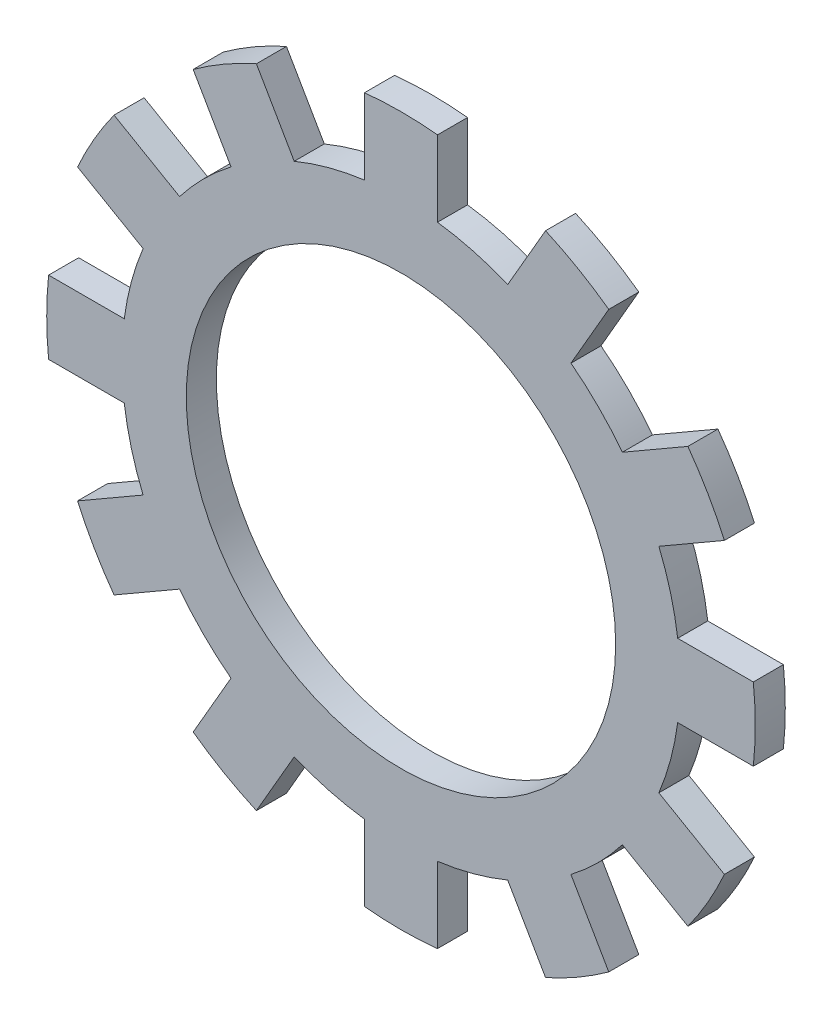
ISO-10303-21;
HEADER;
FILE_DESCRIPTION(('STEP AP214'),'2;1');
FILE_NAME('part.step','',(''),(''),'','','');
FILE_SCHEMA(('AUTOMOTIVE_DESIGN { 1 0 10303 214 1 1 1 1 }'));
ENDSEC;
DATA;
#1=APPLICATION_CONTEXT('core data for automotive mechanical design processes');
#2=APPLICATION_PROTOCOL_DEFINITION('international standard','automotive_design',2000,#1);
#3=PRODUCT_CONTEXT('',#1,'mechanical');
#4=PRODUCT('Part','Part','',(#3));
#5=PRODUCT_RELATED_PRODUCT_CATEGORY('part','',(#4));
#6=PRODUCT_DEFINITION_FORMATION('','',#4);
#7=PRODUCT_DEFINITION_CONTEXT('part definition',#1,'design');
#8=PRODUCT_DEFINITION('design','',#6,#7);
#9=PRODUCT_DEFINITION_SHAPE('','',#8);
#10=(LENGTH_UNIT() NAMED_UNIT(*) SI_UNIT(.MILLI.,.METRE.));
#11=(NAMED_UNIT(*) PLANE_ANGLE_UNIT() SI_UNIT($,.RADIAN.));
#12=(NAMED_UNIT(*) SI_UNIT($,.STERADIAN.) SOLID_ANGLE_UNIT());
#13=UNCERTAINTY_MEASURE_WITH_UNIT(LENGTH_MEASURE(1.E-05),#10,'distance_accuracy_value','');
#14=(GEOMETRIC_REPRESENTATION_CONTEXT(3) GLOBAL_UNCERTAINTY_ASSIGNED_CONTEXT((#13)) GLOBAL_UNIT_ASSIGNED_CONTEXT((#10,
#11,#12)) REPRESENTATION_CONTEXT('',''));
#15=CARTESIAN_POINT('',(0.,0.,0.));
#16=DIRECTION('',(0.,0.,1.));
#17=DIRECTION('',(1.,0.,0.));
#18=AXIS2_PLACEMENT_3D('',#15,#16,#17);
#19=CARTESIAN_POINT('',(0.,0.,0.7));
#20=DIRECTION('',(0.,0.,-1.));
#21=DIRECTION('',(-1.,0.,0.));
#22=AXIS2_PLACEMENT_3D('',#19,#20,#21);
#23=CYLINDRICAL_SURFACE('',#22,13.);
#24=CARTESIAN_POINT('',(0.,0.,-0.7));
#25=DIRECTION('',(0.,0.,1.));
#26=DIRECTION('',(1.,0.,0.));
#27=AXIS2_PLACEMENT_3D('',#24,#25,#26);
#28=CIRCLE('',#27,13.);
#29=CARTESIAN_POINT('',(10.3116531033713,7.91642661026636,-0.7));
#30=VERTEX_POINT('',#29);
#31=CARTESIAN_POINT('',(7.9164266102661,10.3116531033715,-0.7));
#32=VERTEX_POINT('',#31);
#33=EDGE_CURVE('E361',#30,#32,#28,.T.);
#34=ORIENTED_EDGE('',*,*,#33,.T.);
#35=DIRECTION('',(0.,0.,-1.));
#36=VECTOR('',#35,1.);
#37=CARTESIAN_POINT('',(7.9164266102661,10.3116531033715,0.7));
#38=LINE('',#37,#36);
#39=CARTESIAN_POINT('',(7.9164266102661,10.3116531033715,0.7));
#40=VERTEX_POINT('',#39);
#41=EDGE_CURVE('E352',#40,#32,#38,.T.);
#42=ORIENTED_EDGE('',*,*,#41,.F.);
#43=CARTESIAN_POINT('',(0.,0.,0.7));
#44=DIRECTION('',(0.,0.,1.));
#45=DIRECTION('',(1.,0.,0.));
#46=AXIS2_PLACEMENT_3D('',#43,#44,#45);
#47=CIRCLE('',#46,13.);
#48=CARTESIAN_POINT('',(10.3116531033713,7.91642661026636,0.7));
#49=VERTEX_POINT('',#48);
#50=EDGE_CURVE('E64',#49,#40,#47,.T.);
#51=ORIENTED_EDGE('',*,*,#50,.F.);
#52=DIRECTION('',(0.,0.,-1.));
#53=VECTOR('',#52,1.);
#54=CARTESIAN_POINT('',(10.3116531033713,7.91642661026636,0.7));
#55=LINE('',#54,#53);
#56=EDGE_CURVE('E628',#49,#30,#55,.T.);
#57=ORIENTED_EDGE('',*,*,#56,.T.);
#58=EDGE_LOOP('',(#34,#42,#51,#57));
#59=FACE_BOUND('',#58,.T.);
#60=ADVANCED_FACE('F39',(#59),#23,.T.);
#61=DIRECTION('',(0.,0.,-1.));
#62=VECTOR('',#61,1.);
#63=CARTESIAN_POINT('',(4.97194023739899,12.0116531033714,0.7));
#64=LINE('',#63,#62);
#65=CARTESIAN_POINT('',(4.97194023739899,12.0116531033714,0.7));
#66=VERTEX_POINT('',#65);
#67=CARTESIAN_POINT('',(4.97194023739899,12.0116531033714,-0.7));
#68=VERTEX_POINT('',#67);
#69=EDGE_CURVE('E646',#66,#68,#64,.T.);
#70=ORIENTED_EDGE('',*,*,#69,.T.);
#71=CARTESIAN_POINT('',(1.7,12.8883668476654,-0.7));
#72=VERTEX_POINT('',#71);
#73=EDGE_CURVE('E388',#68,#72,#28,.T.);
#74=ORIENTED_EDGE('',*,*,#73,.T.);
#75=DIRECTION('',(0.,0.,-1.));
#76=VECTOR('',#75,1.);
#77=CARTESIAN_POINT('',(1.7,12.8883668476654,0.7));
#78=LINE('',#77,#76);
#79=CARTESIAN_POINT('',(1.7,12.8883668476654,0.7));
#80=VERTEX_POINT('',#79);
#81=EDGE_CURVE('E405',#80,#72,#78,.T.);
#82=ORIENTED_EDGE('',*,*,#81,.F.);
#83=EDGE_CURVE('E50',#66,#80,#47,.T.);
#84=ORIENTED_EDGE('',*,*,#83,.F.);
#85=EDGE_LOOP('',(#70,#74,#82,#84));
#86=FACE_BOUND('',#85,.T.);
#87=ADVANCED_FACE('F816',(#86),#23,.T.);
#88=CARTESIAN_POINT('',(12.8883668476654,1.70000000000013,-0.7));
#89=VERTEX_POINT('',#88);
#90=CARTESIAN_POINT('',(12.0116531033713,4.97194023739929,-0.7));
#91=VERTEX_POINT('',#90);
#92=EDGE_CURVE('E904',#89,#91,#28,.T.);
#93=ORIENTED_EDGE('',*,*,#92,.T.);
#94=DIRECTION('',(0.,0.,-1.));
#95=VECTOR('',#94,1.);
#96=CARTESIAN_POINT('',(12.0116531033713,4.97194023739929,0.7));
#97=LINE('',#96,#95);
#98=CARTESIAN_POINT('',(12.0116531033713,4.97194023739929,0.7));
#99=VERTEX_POINT('',#98);
#100=EDGE_CURVE('E785',#99,#91,#97,.T.);
#101=ORIENTED_EDGE('',*,*,#100,.F.);
#102=CARTESIAN_POINT('',(12.8883668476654,1.70000000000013,0.7));
#103=VERTEX_POINT('',#102);
#104=EDGE_CURVE('E371',#103,#99,#47,.T.);
#105=ORIENTED_EDGE('',*,*,#104,.F.);
#106=DIRECTION('',(0.,0.,-1.));
#107=VECTOR('',#106,1.);
#108=CARTESIAN_POINT('',(12.8883668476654,1.70000000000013,0.7));
#109=LINE('',#108,#107);
#110=EDGE_CURVE('E606',#103,#89,#109,.T.);
#111=ORIENTED_EDGE('',*,*,#110,.T.);
#112=EDGE_LOOP('',(#93,#101,#105,#111));
#113=FACE_BOUND('',#112,.T.);
#114=ADVANCED_FACE('F902',(#113),#23,.T.);
#115=CARTESIAN_POINT('',(12.0116531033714,-4.97194023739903,-0.7));
#116=VERTEX_POINT('',#115);
#117=CARTESIAN_POINT('',(12.8883668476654,-1.69999999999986,-0.7));
#118=VERTEX_POINT('',#117);
#119=EDGE_CURVE('E885',#116,#118,#28,.T.);
#120=ORIENTED_EDGE('',*,*,#119,.T.);
#121=DIRECTION('',(0.,0.,-1.));
#122=VECTOR('',#121,1.);
#123=CARTESIAN_POINT('',(12.8883668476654,-1.69999999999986,0.7));
#124=LINE('',#123,#122);
#125=CARTESIAN_POINT('',(12.8883668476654,-1.69999999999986,0.7));
#126=VERTEX_POINT('',#125);
#127=EDGE_CURVE('E771',#126,#118,#124,.T.);
#128=ORIENTED_EDGE('',*,*,#127,.F.);
#129=CARTESIAN_POINT('',(12.0116531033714,-4.97194023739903,0.7));
#130=VERTEX_POINT('',#129);
#131=EDGE_CURVE('E376',#130,#126,#47,.T.);
#132=ORIENTED_EDGE('',*,*,#131,.F.);
#133=DIRECTION('',(0.,0.,-1.));
#134=VECTOR('',#133,1.);
#135=CARTESIAN_POINT('',(12.0116531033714,-4.97194023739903,0.7));
#136=LINE('',#135,#134);
#137=EDGE_CURVE('E584',#130,#116,#136,.T.);
#138=ORIENTED_EDGE('',*,*,#137,.T.);
#139=EDGE_LOOP('',(#120,#128,#132,#138));
#140=FACE_BOUND('',#139,.T.);
#141=ADVANCED_FACE('F884',(#140),#23,.T.);
#142=CARTESIAN_POINT('',(7.91642661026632,-10.3116531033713,-0.7));
#143=VERTEX_POINT('',#142);
#144=CARTESIAN_POINT('',(10.3116531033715,-7.91642661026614,-0.7));
#145=VERTEX_POINT('',#144);
#146=EDGE_CURVE('E965',#143,#145,#28,.T.);
#147=ORIENTED_EDGE('',*,*,#146,.T.);
#148=DIRECTION('',(0.,0.,-1.));
#149=VECTOR('',#148,1.);
#150=CARTESIAN_POINT('',(10.3116531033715,-7.91642661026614,0.7));
#151=LINE('',#150,#149);
#152=CARTESIAN_POINT('',(10.3116531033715,-7.91642661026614,0.7));
#153=VERTEX_POINT('',#152);
#154=EDGE_CURVE('E757',#153,#145,#151,.T.);
#155=ORIENTED_EDGE('',*,*,#154,.F.);
#156=CARTESIAN_POINT('',(7.91642661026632,-10.3116531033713,0.7));
#157=VERTEX_POINT('',#156);
#158=EDGE_CURVE('E870',#157,#153,#47,.T.);
#159=ORIENTED_EDGE('',*,*,#158,.F.);
#160=DIRECTION('',(0.,0.,-1.));
#161=VECTOR('',#160,1.);
#162=CARTESIAN_POINT('',(7.91642661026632,-10.3116531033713,0.7));
#163=LINE('',#162,#161);
#164=EDGE_CURVE('E562',#157,#143,#163,.T.);
#165=ORIENTED_EDGE('',*,*,#164,.T.);
#166=EDGE_LOOP('',(#147,#155,#159,#165));
#167=FACE_BOUND('',#166,.T.);
#168=ADVANCED_FACE('F974',(#167),#23,.T.);
#169=CARTESIAN_POINT('',(1.7,-12.8883668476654,-0.7));
#170=VERTEX_POINT('',#169);
#171=CARTESIAN_POINT('',(4.97194023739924,-12.0116531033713,-0.7));
#172=VERTEX_POINT('',#171);
#173=EDGE_CURVE('E961',#170,#172,#28,.T.);
#174=ORIENTED_EDGE('',*,*,#173,.T.);
#175=DIRECTION('',(0.,0.,-1.));
#176=VECTOR('',#175,1.);
#177=CARTESIAN_POINT('',(4.97194023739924,-12.0116531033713,0.7));
#178=LINE('',#177,#176);
#179=CARTESIAN_POINT('',(4.97194023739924,-12.0116531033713,0.7));
#180=VERTEX_POINT('',#179);
#181=EDGE_CURVE('E743',#180,#172,#178,.T.);
#182=ORIENTED_EDGE('',*,*,#181,.F.);
#183=CARTESIAN_POINT('',(1.7,-12.8883668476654,0.7));
#184=VERTEX_POINT('',#183);
#185=EDGE_CURVE('E866',#184,#180,#47,.T.);
#186=ORIENTED_EDGE('',*,*,#185,.F.);
#187=DIRECTION('',(0.,0.,-1.));
#188=VECTOR('',#187,1.);
#189=CARTESIAN_POINT('',(1.7,-12.8883668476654,0.7));
#190=LINE('',#189,#188);
#191=EDGE_CURVE('E540',#184,#170,#190,.T.);
#192=ORIENTED_EDGE('',*,*,#191,.T.);
#193=EDGE_LOOP('',(#174,#182,#186,#192));
#194=FACE_BOUND('',#193,.T.);
#195=ADVANCED_FACE('F1402',(#194),#23,.T.);
#196=CARTESIAN_POINT('',(-4.97194023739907,-12.0116531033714,-0.7));
#197=VERTEX_POINT('',#196);
#198=CARTESIAN_POINT('',(-1.7,-12.8883668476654,-0.7));
#199=VERTEX_POINT('',#198);
#200=EDGE_CURVE('E957',#197,#199,#28,.T.);
#201=ORIENTED_EDGE('',*,*,#200,.T.);
#202=DIRECTION('',(0.,0.,-1.));
#203=VECTOR('',#202,1.);
#204=CARTESIAN_POINT('',(-1.7,-12.8883668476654,0.7));
#205=LINE('',#204,#203);
#206=CARTESIAN_POINT('',(-1.7,-12.8883668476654,0.7));
#207=VERTEX_POINT('',#206);
#208=EDGE_CURVE('E729',#207,#199,#205,.T.);
#209=ORIENTED_EDGE('',*,*,#208,.F.);
#210=CARTESIAN_POINT('',(-4.97194023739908,-12.0116531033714,0.7));
#211=VERTEX_POINT('',#210);
#212=EDGE_CURVE('E862',#211,#207,#47,.T.);
#213=ORIENTED_EDGE('',*,*,#212,.F.);
#214=DIRECTION('',(0.,0.,-1.));
#215=VECTOR('',#214,1.);
#216=CARTESIAN_POINT('',(-4.97194023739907,-12.0116531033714,0.7));
#217=LINE('',#216,#215);
#218=EDGE_CURVE('E518',#211,#197,#217,.T.);
#219=ORIENTED_EDGE('',*,*,#218,.T.);
#220=EDGE_LOOP('',(#201,#209,#213,#219));
#221=FACE_BOUND('',#220,.T.);
#222=ADVANCED_FACE('F1394',(#221),#23,.T.);
#223=CARTESIAN_POINT('',(-10.3116531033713,-7.91642661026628,-0.7));
#224=VERTEX_POINT('',#223);
#225=CARTESIAN_POINT('',(-7.91642661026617,-10.3116531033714,-0.7));
#226=VERTEX_POINT('',#225);
#227=EDGE_CURVE('E952',#224,#226,#28,.T.);
#228=ORIENTED_EDGE('',*,*,#227,.T.);
#229=DIRECTION('',(0.,0.,-1.));
#230=VECTOR('',#229,1.);
#231=CARTESIAN_POINT('',(-7.91642661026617,-10.3116531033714,0.7));
#232=LINE('',#231,#230);
#233=CARTESIAN_POINT('',(-7.91642661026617,-10.3116531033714,0.7));
#234=VERTEX_POINT('',#233);
#235=EDGE_CURVE('E715',#234,#226,#232,.T.);
#236=ORIENTED_EDGE('',*,*,#235,.F.);
#237=CARTESIAN_POINT('',(-10.3116531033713,-7.91642661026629,0.7));
#238=VERTEX_POINT('',#237);
#239=EDGE_CURVE('E858',#238,#234,#47,.T.);
#240=ORIENTED_EDGE('',*,*,#239,.F.);
#241=DIRECTION('',(0.,0.,-1.));
#242=VECTOR('',#241,1.);
#243=CARTESIAN_POINT('',(-10.3116531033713,-7.91642661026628,0.7));
#244=LINE('',#243,#242);
#245=EDGE_CURVE('E496',#238,#224,#244,.T.);
#246=ORIENTED_EDGE('',*,*,#245,.T.);
#247=EDGE_LOOP('',(#228,#236,#240,#246));
#248=FACE_BOUND('',#247,.T.);
#249=ADVANCED_FACE('F1386',(#248),#23,.T.);
#250=CARTESIAN_POINT('',(-12.8883668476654,-1.70000000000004,-0.7));
#251=VERTEX_POINT('',#250);
#252=CARTESIAN_POINT('',(-12.0116531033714,-4.9719402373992,-0.7));
#253=VERTEX_POINT('',#252);
#254=EDGE_CURVE('E947',#251,#253,#28,.T.);
#255=ORIENTED_EDGE('',*,*,#254,.T.);
#256=DIRECTION('',(0.,0.,-1.));
#257=VECTOR('',#256,1.);
#258=CARTESIAN_POINT('',(-12.0116531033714,-4.9719402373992,0.7));
#259=LINE('',#258,#257);
#260=CARTESIAN_POINT('',(-12.0116531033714,-4.9719402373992,0.7));
#261=VERTEX_POINT('',#260);
#262=EDGE_CURVE('E701',#261,#253,#259,.T.);
#263=ORIENTED_EDGE('',*,*,#262,.F.);
#264=CARTESIAN_POINT('',(-12.8883668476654,-1.70000000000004,0.7));
#265=VERTEX_POINT('',#264);
#266=EDGE_CURVE('E854',#265,#261,#47,.T.);
#267=ORIENTED_EDGE('',*,*,#266,.F.);
#268=DIRECTION('',(0.,0.,-1.));
#269=VECTOR('',#268,1.);
#270=CARTESIAN_POINT('',(-12.8883668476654,-1.70000000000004,0.7));
#271=LINE('',#270,#269);
#272=EDGE_CURVE('E474',#265,#251,#271,.T.);
#273=ORIENTED_EDGE('',*,*,#272,.T.);
#274=EDGE_LOOP('',(#255,#263,#267,#273));
#275=FACE_BOUND('',#274,.T.);
#276=ADVANCED_FACE('F937',(#275),#23,.T.);
#277=CARTESIAN_POINT('',(-12.0116531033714,4.97194023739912,-0.7));
#278=VERTEX_POINT('',#277);
#279=CARTESIAN_POINT('',(-12.8883668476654,1.69999999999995,-0.7));
#280=VERTEX_POINT('',#279);
#281=EDGE_CURVE('E942',#278,#280,#28,.T.);
#282=ORIENTED_EDGE('',*,*,#281,.T.);
#283=DIRECTION('',(0.,0.,-1.));
#284=VECTOR('',#283,1.);
#285=CARTESIAN_POINT('',(-12.8883668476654,1.69999999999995,0.7));
#286=LINE('',#285,#284);
#287=CARTESIAN_POINT('',(-12.8883668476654,1.69999999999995,0.7));
#288=VERTEX_POINT('',#287);
#289=EDGE_CURVE('E687',#288,#280,#286,.T.);
#290=ORIENTED_EDGE('',*,*,#289,.F.);
#291=CARTESIAN_POINT('',(-12.0116531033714,4.97194023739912,0.7));
#292=VERTEX_POINT('',#291);
#293=EDGE_CURVE('E851',#292,#288,#47,.T.);
#294=ORIENTED_EDGE('',*,*,#293,.F.);
#295=DIRECTION('',(0.,0.,-1.));
#296=VECTOR('',#295,1.);
#297=CARTESIAN_POINT('',(-12.0116531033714,4.97194023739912,0.7));
#298=LINE('',#297,#296);
#299=EDGE_CURVE('E452',#292,#278,#298,.T.);
#300=ORIENTED_EDGE('',*,*,#299,.T.);
#301=EDGE_LOOP('',(#282,#290,#294,#300));
#302=FACE_BOUND('',#301,.T.);
#303=ADVANCED_FACE('F933',(#302),#23,.T.);
#304=CARTESIAN_POINT('',(-7.91642661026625,10.3116531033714,-0.7));
#305=VERTEX_POINT('',#304);
#306=CARTESIAN_POINT('',(-10.3116531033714,7.91642661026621,-0.7));
#307=VERTEX_POINT('',#306);
#308=EDGE_CURVE('E940',#305,#307,#28,.T.);
#309=ORIENTED_EDGE('',*,*,#308,.T.);
#310=DIRECTION('',(0.,0.,-1.));
#311=VECTOR('',#310,1.);
#312=CARTESIAN_POINT('',(-10.3116531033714,7.91642661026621,0.7));
#313=LINE('',#312,#311);
#314=CARTESIAN_POINT('',(-10.3116531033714,7.91642661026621,0.7));
#315=VERTEX_POINT('',#314);
#316=EDGE_CURVE('E673',#315,#307,#313,.T.);
#317=ORIENTED_EDGE('',*,*,#316,.F.);
#318=CARTESIAN_POINT('',(-7.91642661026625,10.3116531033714,0.7));
#319=VERTEX_POINT('',#318);
#320=EDGE_CURVE('E49',#319,#315,#47,.T.);
#321=ORIENTED_EDGE('',*,*,#320,.F.);
#322=DIRECTION('',(0.,0.,-1.));
#323=VECTOR('',#322,1.);
#324=CARTESIAN_POINT('',(-7.91642661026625,10.3116531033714,0.7));
#325=LINE('',#324,#323);
#326=EDGE_CURVE('E430',#319,#305,#325,.T.);
#327=ORIENTED_EDGE('',*,*,#326,.T.);
#328=EDGE_LOOP('',(#309,#317,#321,#327));
#329=FACE_BOUND('',#328,.T.);
#330=ADVANCED_FACE('F927',(#329),#23,.T.);
#331=CARTESIAN_POINT('',(-1.7,12.8883668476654,-0.7));
#332=VERTEX_POINT('',#331);
#333=CARTESIAN_POINT('',(-4.97194023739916,12.0116531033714,-0.7));
#334=VERTEX_POINT('',#333);
#335=EDGE_CURVE('E43',#332,#334,#28,.T.);
#336=ORIENTED_EDGE('',*,*,#335,.T.);
#337=DIRECTION('',(0.,0.,-1.));
#338=VECTOR('',#337,1.);
#339=CARTESIAN_POINT('',(-4.97194023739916,12.0116531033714,0.7));
#340=LINE('',#339,#338);
#341=CARTESIAN_POINT('',(-4.97194023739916,12.0116531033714,0.7));
#342=VERTEX_POINT('',#341);
#343=EDGE_CURVE('E658',#342,#334,#340,.T.);
#344=ORIENTED_EDGE('',*,*,#343,.F.);
#345=CARTESIAN_POINT('',(-1.7,12.8883668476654,0.7));
#346=VERTEX_POINT('',#345);
#347=EDGE_CURVE('E11',#346,#342,#47,.T.);
#348=ORIENTED_EDGE('',*,*,#347,.F.);
#349=DIRECTION('',(0.,0.,-1.));
#350=VECTOR('',#349,1.);
#351=CARTESIAN_POINT('',(-1.7,12.8883668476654,0.7));
#352=LINE('',#351,#350);
#353=EDGE_CURVE('E392',#346,#332,#352,.T.);
#354=ORIENTED_EDGE('',*,*,#353,.T.);
#355=EDGE_LOOP('',(#336,#344,#348,#354));
#356=FACE_BOUND('',#355,.T.);
#357=ADVANCED_FACE('F41',(#356),#23,.T.);
#358=CARTESIAN_POINT('',(0.,0.,0.7));
#359=DIRECTION('',(0.,0.,1.));
#360=DIRECTION('',(1.,0.,0.));
#361=AXIS2_PLACEMENT_3D('',#358,#359,#360);
#362=PLANE('',#361);
#363=ORIENTED_EDGE('',*,*,#347,.T.);
#364=DIRECTION('',(0.500000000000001,-0.866025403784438,0.));
#365=VECTOR('',#364,1.);
#366=CARTESIAN_POINT('',(-6.73385210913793,15.0633739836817,0.7));
#367=LINE('',#366,#365);
#368=CARTESIAN_POINT('',(-6.73385210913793,15.0633739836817,0.7));
#369=VERTEX_POINT('',#368);
#370=EDGE_CURVE('E669',#369,#342,#367,.T.);
#371=ORIENTED_EDGE('',*,*,#370,.F.);
#372=CARTESIAN_POINT('',(0.,0.,0.7));
#373=DIRECTION('',(0.,0.,1.));
#374=DIRECTION('',(0.866025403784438,0.500000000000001,0.));
#375=AXIS2_PLACEMENT_3D('',#372,#373,#374);
#376=CIRCLE('',#375,16.5);
#377=CARTESIAN_POINT('',(-9.67833848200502,13.3633739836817,0.7));
#378=VERTEX_POINT('',#377);
#379=EDGE_CURVE('E439',#369,#378,#376,.T.);
#380=ORIENTED_EDGE('',*,*,#379,.T.);
#381=DIRECTION('',(0.500000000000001,-0.866025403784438,0.));
#382=VECTOR('',#381,1.);
#383=CARTESIAN_POINT('',(-9.67833848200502,13.3633739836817,0.7));
#384=LINE('',#383,#382);
#385=EDGE_CURVE('E434',#378,#319,#384,.T.);
#386=ORIENTED_EDGE('',*,*,#385,.T.);
#387=ORIENTED_EDGE('',*,*,#320,.T.);
#388=DIRECTION('',(0.86602540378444,-0.499999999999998,0.));
#389=VECTOR('',#388,1.);
#390=CARTESIAN_POINT('',(-13.3633739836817,9.67833848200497,0.7));
#391=LINE('',#390,#389);
#392=CARTESIAN_POINT('',(-13.3633739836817,9.67833848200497,0.7));
#393=VERTEX_POINT('',#392);
#394=EDGE_CURVE('E682',#393,#315,#391,.T.);
#395=ORIENTED_EDGE('',*,*,#394,.F.);
#396=CARTESIAN_POINT('',(0.,0.,0.7));
#397=DIRECTION('',(0.,0.,1.));
#398=DIRECTION('',(0.499999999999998,0.86602540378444,0.));
#399=AXIS2_PLACEMENT_3D('',#396,#397,#398);
#400=CIRCLE('',#399,16.5);
#401=CARTESIAN_POINT('',(-15.0633739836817,6.73385210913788,0.7));
#402=VERTEX_POINT('',#401);
#403=EDGE_CURVE('E461',#393,#402,#400,.T.);
#404=ORIENTED_EDGE('',*,*,#403,.T.);
#405=DIRECTION('',(0.86602540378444,-0.499999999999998,0.));
#406=VECTOR('',#405,1.);
#407=CARTESIAN_POINT('',(-15.0633739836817,6.73385210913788,0.7));
#408=LINE('',#407,#406);
#409=EDGE_CURVE('E456',#402,#292,#408,.T.);
#410=ORIENTED_EDGE('',*,*,#409,.T.);
#411=ORIENTED_EDGE('',*,*,#293,.T.);
#412=DIRECTION('',(1.,0.,0.));
#413=VECTOR('',#412,1.);
#414=CARTESIAN_POINT('',(-16.4121905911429,1.69999999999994,0.7));
#415=LINE('',#414,#413);
#416=CARTESIAN_POINT('',(-16.4121905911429,1.69999999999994,0.7));
#417=VERTEX_POINT('',#416);
#418=EDGE_CURVE('E696',#417,#288,#415,.T.);
#419=ORIENTED_EDGE('',*,*,#418,.F.);
#420=CARTESIAN_POINT('',(0.,0.,0.7));
#421=DIRECTION('',(0.,0.,1.));
#422=DIRECTION('',(0.,1.,0.));
#423=AXIS2_PLACEMENT_3D('',#420,#421,#422);
#424=CIRCLE('',#423,16.5);
#425=CARTESIAN_POINT('',(-16.4121905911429,-1.70000000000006,0.7));
#426=VERTEX_POINT('',#425);
#427=EDGE_CURVE('E483',#417,#426,#424,.T.);
#428=ORIENTED_EDGE('',*,*,#427,.T.);
#429=DIRECTION('',(1.,0.,0.));
#430=VECTOR('',#429,1.);
#431=CARTESIAN_POINT('',(-16.4121905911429,-1.70000000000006,0.7));
#432=LINE('',#431,#430);
#433=EDGE_CURVE('E478',#426,#265,#432,.T.);
#434=ORIENTED_EDGE('',*,*,#433,.T.);
#435=ORIENTED_EDGE('',*,*,#266,.T.);
#436=DIRECTION('',(0.866025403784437,0.500000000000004,0.));
#437=VECTOR('',#436,1.);
#438=CARTESIAN_POINT('',(-15.0633739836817,-6.73385210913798,0.7));
#439=LINE('',#438,#437);
#440=CARTESIAN_POINT('',(-15.0633739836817,-6.73385210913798,0.7));
#441=VERTEX_POINT('',#440);
#442=EDGE_CURVE('E710',#441,#261,#439,.T.);
#443=ORIENTED_EDGE('',*,*,#442,.F.);
#444=CARTESIAN_POINT('',(0.,0.,0.7));
#445=DIRECTION('',(0.,0.,1.));
#446=DIRECTION('',(-0.500000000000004,0.866025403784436,0.));
#447=AXIS2_PLACEMENT_3D('',#444,#445,#446);
#448=CIRCLE('',#447,16.5);
#449=CARTESIAN_POINT('',(-13.3633739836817,-9.67833848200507,0.7));
#450=VERTEX_POINT('',#449);
#451=EDGE_CURVE('E505',#441,#450,#448,.T.);
#452=ORIENTED_EDGE('',*,*,#451,.T.);
#453=DIRECTION('',(0.866025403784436,0.500000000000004,0.));
#454=VECTOR('',#453,1.);
#455=CARTESIAN_POINT('',(-13.3633739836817,-9.67833848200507,0.7));
#456=LINE('',#455,#454);
#457=EDGE_CURVE('E500',#450,#238,#456,.T.);
#458=ORIENTED_EDGE('',*,*,#457,.T.);
#459=ORIENTED_EDGE('',*,*,#239,.T.);
#460=DIRECTION('',(0.499999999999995,0.866025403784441,0.));
#461=VECTOR('',#460,1.);
#462=CARTESIAN_POINT('',(-9.67833848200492,-13.3633739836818,0.7));
#463=LINE('',#462,#461);
#464=CARTESIAN_POINT('',(-9.67833848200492,-13.3633739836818,0.7));
#465=VERTEX_POINT('',#464);
#466=EDGE_CURVE('E724',#465,#234,#463,.T.);
#467=ORIENTED_EDGE('',*,*,#466,.F.);
#468=CARTESIAN_POINT('',(0.,0.,0.7));
#469=DIRECTION('',(0.,0.,1.));
#470=DIRECTION('',(-0.866025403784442,0.499999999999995,0.));
#471=AXIS2_PLACEMENT_3D('',#468,#469,#470);
#472=CIRCLE('',#471,16.5);
#473=CARTESIAN_POINT('',(-6.73385210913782,-15.0633739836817,0.7));
#474=VERTEX_POINT('',#473);
#475=EDGE_CURVE('E527',#465,#474,#472,.T.);
#476=ORIENTED_EDGE('',*,*,#475,.T.);
#477=DIRECTION('',(0.499999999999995,0.866025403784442,0.));
#478=VECTOR('',#477,1.);
#479=CARTESIAN_POINT('',(-6.73385210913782,-15.0633739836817,0.7));
#480=LINE('',#479,#478);
#481=EDGE_CURVE('E522',#474,#211,#480,.T.);
#482=ORIENTED_EDGE('',*,*,#481,.T.);
#483=ORIENTED_EDGE('',*,*,#212,.T.);
#484=DIRECTION('',(0.,1.,0.));
#485=VECTOR('',#484,1.);
#486=CARTESIAN_POINT('',(-1.7,-16.4121905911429,0.7));
#487=LINE('',#486,#485);
#488=CARTESIAN_POINT('',(-1.7,-16.4121905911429,0.7));
#489=VERTEX_POINT('',#488);
#490=EDGE_CURVE('E738',#489,#207,#487,.T.);
#491=ORIENTED_EDGE('',*,*,#490,.F.);
#492=CARTESIAN_POINT('',(0.,0.,0.7));
#493=DIRECTION('',(0.,0.,1.));
#494=DIRECTION('',(-1.,0.,0.));
#495=AXIS2_PLACEMENT_3D('',#492,#493,#494);
#496=CIRCLE('',#495,16.5);
#497=CARTESIAN_POINT('',(1.7,-16.4121905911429,0.7));
#498=VERTEX_POINT('',#497);
#499=EDGE_CURVE('E549',#489,#498,#496,.T.);
#500=ORIENTED_EDGE('',*,*,#499,.T.);
#501=DIRECTION('',(0.,1.,0.));
#502=VECTOR('',#501,1.);
#503=CARTESIAN_POINT('',(1.7,-16.4121905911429,0.7));
#504=LINE('',#503,#502);
#505=EDGE_CURVE('E544',#498,#184,#504,.T.);
#506=ORIENTED_EDGE('',*,*,#505,.T.);
#507=ORIENTED_EDGE('',*,*,#185,.T.);
#508=DIRECTION('',(-0.500000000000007,0.866025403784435,0.));
#509=VECTOR('',#508,1.);
#510=CARTESIAN_POINT('',(6.73385210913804,-15.0633739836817,0.7));
#511=LINE('',#510,#509);
#512=CARTESIAN_POINT('',(6.73385210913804,-15.0633739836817,0.7));
#513=VERTEX_POINT('',#512);
#514=EDGE_CURVE('E752',#513,#180,#511,.T.);
#515=ORIENTED_EDGE('',*,*,#514,.F.);
#516=CARTESIAN_POINT('',(0.,0.,0.7));
#517=DIRECTION('',(0.,0.,1.));
#518=DIRECTION('',(-0.866025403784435,-0.500000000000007,0.));
#519=AXIS2_PLACEMENT_3D('',#516,#517,#518);
#520=CIRCLE('',#519,16.5);
#521=CARTESIAN_POINT('',(9.67833848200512,-13.3633739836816,0.7));
#522=VERTEX_POINT('',#521);
#523=EDGE_CURVE('E571',#513,#522,#520,.T.);
#524=ORIENTED_EDGE('',*,*,#523,.T.);
#525=DIRECTION('',(-0.500000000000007,0.866025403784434,0.));
#526=VECTOR('',#525,1.);
#527=CARTESIAN_POINT('',(9.67833848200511,-13.3633739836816,0.7));
#528=LINE('',#527,#526);
#529=EDGE_CURVE('E566',#522,#157,#528,.T.);
#530=ORIENTED_EDGE('',*,*,#529,.T.);
#531=ORIENTED_EDGE('',*,*,#158,.T.);
#532=DIRECTION('',(-0.866025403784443,0.499999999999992,0.));
#533=VECTOR('',#532,1.);
#534=CARTESIAN_POINT('',(13.3633739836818,-9.67833848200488,0.7));
#535=LINE('',#534,#533);
#536=CARTESIAN_POINT('',(13.3633739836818,-9.67833848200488,0.7));
#537=VERTEX_POINT('',#536);
#538=EDGE_CURVE('E766',#537,#153,#535,.T.);
#539=ORIENTED_EDGE('',*,*,#538,.F.);
#540=CARTESIAN_POINT('',(0.,0.,0.7));
#541=DIRECTION('',(0.,0.,1.));
#542=DIRECTION('',(-0.499999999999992,-0.866025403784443,0.));
#543=AXIS2_PLACEMENT_3D('',#540,#541,#542);
#544=CIRCLE('',#543,16.5);
#545=CARTESIAN_POINT('',(15.0633739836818,-6.73385210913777,0.7));
#546=VERTEX_POINT('',#545);
#547=EDGE_CURVE('E593',#537,#546,#544,.T.);
#548=ORIENTED_EDGE('',*,*,#547,.T.);
#549=DIRECTION('',(-0.866025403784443,0.499999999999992,0.));
#550=VECTOR('',#549,1.);
#551=CARTESIAN_POINT('',(15.0633739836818,-6.73385210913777,0.7));
#552=LINE('',#551,#550);
#553=EDGE_CURVE('E588',#546,#130,#552,.T.);
#554=ORIENTED_EDGE('',*,*,#553,.T.);
#555=ORIENTED_EDGE('',*,*,#131,.T.);
#556=DIRECTION('',(-1.,0.,0.));
#557=VECTOR('',#556,1.);
#558=CARTESIAN_POINT('',(16.4121905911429,-1.69999999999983,0.7));
#559=LINE('',#558,#557);
#560=CARTESIAN_POINT('',(16.4121905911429,-1.69999999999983,0.7));
#561=VERTEX_POINT('',#560);
#562=EDGE_CURVE('E780',#561,#126,#559,.T.);
#563=ORIENTED_EDGE('',*,*,#562,.F.);
#564=CARTESIAN_POINT('',(0.,0.,0.7));
#565=DIRECTION('',(0.,0.,1.));
#566=DIRECTION('',(0.,-1.,0.));
#567=AXIS2_PLACEMENT_3D('',#564,#565,#566);
#568=CIRCLE('',#567,16.5);
#569=CARTESIAN_POINT('',(16.4121905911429,1.70000000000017,0.7));
#570=VERTEX_POINT('',#569);
#571=EDGE_CURVE('E615',#561,#570,#568,.T.);
#572=ORIENTED_EDGE('',*,*,#571,.T.);
#573=DIRECTION('',(-1.,0.,0.));
#574=VECTOR('',#573,1.);
#575=CARTESIAN_POINT('',(16.4121905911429,1.70000000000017,0.7));
#576=LINE('',#575,#574);
#577=EDGE_CURVE('E610',#570,#103,#576,.T.);
#578=ORIENTED_EDGE('',*,*,#577,.T.);
#579=ORIENTED_EDGE('',*,*,#104,.T.);
#580=DIRECTION('',(-0.866025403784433,-0.50000000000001,0.));
#581=VECTOR('',#580,1.);
#582=CARTESIAN_POINT('',(15.0633739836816,6.73385210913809,0.7));
#583=LINE('',#582,#581);
#584=CARTESIAN_POINT('',(15.0633739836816,6.73385210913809,0.7));
#585=VERTEX_POINT('',#584);
#586=EDGE_CURVE('E794',#585,#99,#583,.T.);
#587=ORIENTED_EDGE('',*,*,#586,.F.);
#588=CARTESIAN_POINT('',(0.,0.,0.7));
#589=DIRECTION('',(0.,0.,1.));
#590=DIRECTION('',(0.50000000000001,-0.866025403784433,0.));
#591=AXIS2_PLACEMENT_3D('',#588,#589,#590);
#592=CIRCLE('',#591,16.5);
#593=CARTESIAN_POINT('',(13.3633739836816,9.67833848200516,0.7));
#594=VERTEX_POINT('',#593);
#595=EDGE_CURVE('E634',#585,#594,#592,.T.);
#596=ORIENTED_EDGE('',*,*,#595,.T.);
#597=DIRECTION('',(-0.866025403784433,-0.50000000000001,0.));
#598=VECTOR('',#597,1.);
#599=CARTESIAN_POINT('',(13.3633739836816,9.67833848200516,0.7));
#600=LINE('',#599,#598);
#601=EDGE_CURVE('E368',#594,#49,#600,.T.);
#602=ORIENTED_EDGE('',*,*,#601,.T.);
#603=ORIENTED_EDGE('',*,*,#50,.T.);
#604=DIRECTION('',(-0.499999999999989,-0.866025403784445,0.));
#605=VECTOR('',#604,1.);
#606=CARTESIAN_POINT('',(9.67833848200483,13.3633739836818,0.7));
#607=LINE('',#606,#605);
#608=CARTESIAN_POINT('',(9.67833848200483,13.3633739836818,0.7));
#609=VERTEX_POINT('',#608);
#610=EDGE_CURVE('E349',#609,#40,#607,.T.);
#611=ORIENTED_EDGE('',*,*,#610,.F.);
#612=CARTESIAN_POINT('',(0.,0.,0.7));
#613=DIRECTION('',(0.,0.,1.));
#614=DIRECTION('',(0.866025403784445,-0.499999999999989,0.));
#615=AXIS2_PLACEMENT_3D('',#612,#613,#614);
#616=CIRCLE('',#615,16.5);
#617=CARTESIAN_POINT('',(6.73385210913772,15.0633739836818,0.7));
#618=VERTEX_POINT('',#617);
#619=EDGE_CURVE('E654',#609,#618,#616,.T.);
#620=ORIENTED_EDGE('',*,*,#619,.T.);
#621=DIRECTION('',(-0.499999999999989,-0.866025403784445,0.));
#622=VECTOR('',#621,1.);
#623=CARTESIAN_POINT('',(6.73385210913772,15.0633739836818,0.7));
#624=LINE('',#623,#622);
#625=EDGE_CURVE('E649',#618,#66,#624,.T.);
#626=ORIENTED_EDGE('',*,*,#625,.T.);
#627=ORIENTED_EDGE('',*,*,#83,.T.);
#628=DIRECTION('',(0.,-1.,0.));
#629=VECTOR('',#628,1.);
#630=CARTESIAN_POINT('',(1.7,16.4121905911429,0.7));
#631=LINE('',#630,#629);
#632=CARTESIAN_POINT('',(1.7,16.4121905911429,0.7));
#633=VERTEX_POINT('',#632);
#634=EDGE_CURVE('E418',#633,#80,#631,.T.);
#635=ORIENTED_EDGE('',*,*,#634,.F.);
#636=CARTESIAN_POINT('',(0.,0.,0.7));
#637=DIRECTION('',(0.,0.,1.));
#638=DIRECTION('',(1.,0.,0.));
#639=AXIS2_PLACEMENT_3D('',#636,#637,#638);
#640=CIRCLE('',#639,16.5);
#641=CARTESIAN_POINT('',(-1.7,16.4121905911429,0.7));
#642=VERTEX_POINT('',#641);
#643=EDGE_CURVE('E401',#633,#642,#640,.T.);
#644=ORIENTED_EDGE('',*,*,#643,.T.);
#645=DIRECTION('',(0.,-1.,0.));
#646=VECTOR('',#645,1.);
#647=CARTESIAN_POINT('',(-1.7,16.4121905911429,0.7));
#648=LINE('',#647,#646);
#649=EDGE_CURVE('E396',#642,#346,#648,.T.);
#650=ORIENTED_EDGE('',*,*,#649,.T.);
#651=EDGE_LOOP('',(#363,#371,#380,#386,#387,#395,#404,#410,#411,#419,#428,#434,#435,#443,#452,
#458,#459,#467,#476,#482,#483,#491,#500,#506,#507,#515,#524,#530,#531,#539,#548,#554,#555,#563,
#572,#578,#579,#587,#596,#602,#603,#611,#620,#626,#627,#635,#644,#650));
#652=FACE_BOUND('',#651,.T.);
#653=CARTESIAN_POINT('',(0.,0.,0.7));
#654=DIRECTION('',(0.,0.,1.));
#655=DIRECTION('',(1.,0.,0.));
#656=AXIS2_PLACEMENT_3D('',#653,#654,#655);
#657=CIRCLE('',#656,10.);
#658=CARTESIAN_POINT('',(10.,0.,0.7));
#659=VERTEX_POINT('',#658);
#660=EDGE_CURVE('E383',#659,#659,#657,.T.);
#661=ORIENTED_EDGE('',*,*,#660,.F.);
#662=EDGE_LOOP('',(#661));
#663=FACE_BOUND('',#662,.T.);
#664=ADVANCED_FACE('F365',(#652,#663),#362,.T.);
#665=CARTESIAN_POINT('',(0.,0.,-0.7));
#666=DIRECTION('',(0.,0.,1.));
#667=DIRECTION('',(1.,0.,0.));
#668=AXIS2_PLACEMENT_3D('',#665,#666,#667);
#669=PLANE('',#668);
#670=ORIENTED_EDGE('',*,*,#335,.F.);
#671=DIRECTION('',(0.,-1.,0.));
#672=VECTOR('',#671,1.);
#673=CARTESIAN_POINT('',(-1.7,16.4121905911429,-0.7));
#674=LINE('',#673,#672);
#675=CARTESIAN_POINT('',(-1.7,16.4121905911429,-0.7));
#676=VERTEX_POINT('',#675);
#677=EDGE_CURVE('E397',#676,#332,#674,.T.);
#678=ORIENTED_EDGE('',*,*,#677,.F.);
#679=CARTESIAN_POINT('',(0.,0.,-0.7));
#680=DIRECTION('',(0.,0.,1.));
#681=DIRECTION('',(1.,0.,0.));
#682=AXIS2_PLACEMENT_3D('',#679,#680,#681);
#683=CIRCLE('',#682,16.5);
#684=CARTESIAN_POINT('',(1.7,16.4121905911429,-0.7));
#685=VERTEX_POINT('',#684);
#686=EDGE_CURVE('E402',#685,#676,#683,.T.);
#687=ORIENTED_EDGE('',*,*,#686,.F.);
#688=DIRECTION('',(0.,-1.,0.));
#689=VECTOR('',#688,1.);
#690=CARTESIAN_POINT('',(1.7,16.4121905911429,-0.7));
#691=LINE('',#690,#689);
#692=EDGE_CURVE('E419',#685,#72,#691,.T.);
#693=ORIENTED_EDGE('',*,*,#692,.T.);
#694=ORIENTED_EDGE('',*,*,#73,.F.);
#695=DIRECTION('',(-0.499999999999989,-0.866025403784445,0.));
#696=VECTOR('',#695,1.);
#697=CARTESIAN_POINT('',(6.73385210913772,15.0633739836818,-0.7));
#698=LINE('',#697,#696);
#699=CARTESIAN_POINT('',(6.73385210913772,15.0633739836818,-0.7));
#700=VERTEX_POINT('',#699);
#701=EDGE_CURVE('E650',#700,#68,#698,.T.);
#702=ORIENTED_EDGE('',*,*,#701,.F.);
#703=CARTESIAN_POINT('',(0.,0.,-0.7));
#704=DIRECTION('',(0.,0.,1.));
#705=DIRECTION('',(0.866025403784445,-0.499999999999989,0.));
#706=AXIS2_PLACEMENT_3D('',#703,#704,#705);
#707=CIRCLE('',#706,16.5);
#708=CARTESIAN_POINT('',(9.67833848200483,13.3633739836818,-0.7));
#709=VERTEX_POINT('',#708);
#710=EDGE_CURVE('E655',#709,#700,#707,.T.);
#711=ORIENTED_EDGE('',*,*,#710,.F.);
#712=DIRECTION('',(-0.499999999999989,-0.866025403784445,0.));
#713=VECTOR('',#712,1.);
#714=CARTESIAN_POINT('',(9.67833848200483,13.3633739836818,-0.7));
#715=LINE('',#714,#713);
#716=EDGE_CURVE('E358',#709,#32,#715,.T.);
#717=ORIENTED_EDGE('',*,*,#716,.T.);
#718=ORIENTED_EDGE('',*,*,#33,.F.);
#719=DIRECTION('',(-0.866025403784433,-0.50000000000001,0.));
#720=VECTOR('',#719,1.);
#721=CARTESIAN_POINT('',(13.3633739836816,9.67833848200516,-0.7));
#722=LINE('',#721,#720);
#723=CARTESIAN_POINT('',(13.3633739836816,9.67833848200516,-0.7));
#724=VERTEX_POINT('',#723);
#725=EDGE_CURVE('E630',#724,#30,#722,.T.);
#726=ORIENTED_EDGE('',*,*,#725,.F.);
#727=CARTESIAN_POINT('',(0.,0.,-0.7));
#728=DIRECTION('',(0.,0.,1.));
#729=DIRECTION('',(0.50000000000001,-0.866025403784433,0.));
#730=AXIS2_PLACEMENT_3D('',#727,#728,#729);
#731=CIRCLE('',#730,16.5);
#732=CARTESIAN_POINT('',(15.0633739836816,6.73385210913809,-0.7));
#733=VERTEX_POINT('',#732);
#734=EDGE_CURVE('E635',#733,#724,#731,.T.);
#735=ORIENTED_EDGE('',*,*,#734,.F.);
#736=DIRECTION('',(-0.866025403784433,-0.50000000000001,0.));
#737=VECTOR('',#736,1.);
#738=CARTESIAN_POINT('',(15.0633739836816,6.73385210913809,-0.7));
#739=LINE('',#738,#737);
#740=EDGE_CURVE('E363',#733,#91,#739,.T.);
#741=ORIENTED_EDGE('',*,*,#740,.T.);
#742=ORIENTED_EDGE('',*,*,#92,.F.);
#743=DIRECTION('',(-1.,0.,0.));
#744=VECTOR('',#743,1.);
#745=CARTESIAN_POINT('',(16.4121905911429,1.70000000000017,-0.7));
#746=LINE('',#745,#744);
#747=CARTESIAN_POINT('',(16.4121905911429,1.70000000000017,-0.7));
#748=VERTEX_POINT('',#747);
#749=EDGE_CURVE('E611',#748,#89,#746,.T.);
#750=ORIENTED_EDGE('',*,*,#749,.F.);
#751=CARTESIAN_POINT('',(0.,0.,-0.7));
#752=DIRECTION('',(0.,0.,1.));
#753=DIRECTION('',(0.,-1.,0.));
#754=AXIS2_PLACEMENT_3D('',#751,#752,#753);
#755=CIRCLE('',#754,16.5);
#756=CARTESIAN_POINT('',(16.4121905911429,-1.69999999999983,-0.7));
#757=VERTEX_POINT('',#756);
#758=EDGE_CURVE('E616',#757,#748,#755,.T.);
#759=ORIENTED_EDGE('',*,*,#758,.F.);
#760=DIRECTION('',(-1.,0.,0.));
#761=VECTOR('',#760,1.);
#762=CARTESIAN_POINT('',(16.4121905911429,-1.69999999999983,-0.7));
#763=LINE('',#762,#761);
#764=EDGE_CURVE('E781',#757,#118,#763,.T.);
#765=ORIENTED_EDGE('',*,*,#764,.T.);
#766=ORIENTED_EDGE('',*,*,#119,.F.);
#767=DIRECTION('',(-0.866025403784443,0.499999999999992,0.));
#768=VECTOR('',#767,1.);
#769=CARTESIAN_POINT('',(15.0633739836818,-6.73385210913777,-0.7));
#770=LINE('',#769,#768);
#771=CARTESIAN_POINT('',(15.0633739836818,-6.73385210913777,-0.7));
#772=VERTEX_POINT('',#771);
#773=EDGE_CURVE('E589',#772,#116,#770,.T.);
#774=ORIENTED_EDGE('',*,*,#773,.F.);
#775=CARTESIAN_POINT('',(0.,0.,-0.7));
#776=DIRECTION('',(0.,0.,1.));
#777=DIRECTION('',(-0.499999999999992,-0.866025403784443,0.));
#778=AXIS2_PLACEMENT_3D('',#775,#776,#777);
#779=CIRCLE('',#778,16.5);
#780=CARTESIAN_POINT('',(13.3633739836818,-9.67833848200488,-0.7));
#781=VERTEX_POINT('',#780);
#782=EDGE_CURVE('E594',#781,#772,#779,.T.);
#783=ORIENTED_EDGE('',*,*,#782,.F.);
#784=DIRECTION('',(-0.866025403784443,0.499999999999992,0.));
#785=VECTOR('',#784,1.);
#786=CARTESIAN_POINT('',(13.3633739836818,-9.67833848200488,-0.7));
#787=LINE('',#786,#785);
#788=EDGE_CURVE('E767',#781,#145,#787,.T.);
#789=ORIENTED_EDGE('',*,*,#788,.T.);
#790=ORIENTED_EDGE('',*,*,#146,.F.);
#791=DIRECTION('',(-0.500000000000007,0.866025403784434,0.));
#792=VECTOR('',#791,1.);
#793=CARTESIAN_POINT('',(9.67833848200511,-13.3633739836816,-0.7));
#794=LINE('',#793,#792);
#795=CARTESIAN_POINT('',(9.67833848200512,-13.3633739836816,-0.7));
#796=VERTEX_POINT('',#795);
#797=EDGE_CURVE('E567',#796,#143,#794,.T.);
#798=ORIENTED_EDGE('',*,*,#797,.F.);
#799=CARTESIAN_POINT('',(0.,0.,-0.7));
#800=DIRECTION('',(0.,0.,1.));
#801=DIRECTION('',(-0.866025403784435,-0.500000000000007,0.));
#802=AXIS2_PLACEMENT_3D('',#799,#800,#801);
#803=CIRCLE('',#802,16.5);
#804=CARTESIAN_POINT('',(6.73385210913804,-15.0633739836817,-0.7));
#805=VERTEX_POINT('',#804);
#806=EDGE_CURVE('E572',#805,#796,#803,.T.);
#807=ORIENTED_EDGE('',*,*,#806,.F.);
#808=DIRECTION('',(-0.500000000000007,0.866025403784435,0.));
#809=VECTOR('',#808,1.);
#810=CARTESIAN_POINT('',(6.73385210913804,-15.0633739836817,-0.7));
#811=LINE('',#810,#809);
#812=EDGE_CURVE('E753',#805,#172,#811,.T.);
#813=ORIENTED_EDGE('',*,*,#812,.T.);
#814=ORIENTED_EDGE('',*,*,#173,.F.);
#815=DIRECTION('',(0.,1.,0.));
#816=VECTOR('',#815,1.);
#817=CARTESIAN_POINT('',(1.7,-16.4121905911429,-0.7));
#818=LINE('',#817,#816);
#819=CARTESIAN_POINT('',(1.7,-16.4121905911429,-0.7));
#820=VERTEX_POINT('',#819);
#821=EDGE_CURVE('E545',#820,#170,#818,.T.);
#822=ORIENTED_EDGE('',*,*,#821,.F.);
#823=CARTESIAN_POINT('',(0.,0.,-0.7));
#824=DIRECTION('',(0.,0.,1.));
#825=DIRECTION('',(-1.,0.,0.));
#826=AXIS2_PLACEMENT_3D('',#823,#824,#825);
#827=CIRCLE('',#826,16.5);
#828=CARTESIAN_POINT('',(-1.7,-16.4121905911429,-0.7));
#829=VERTEX_POINT('',#828);
#830=EDGE_CURVE('E550',#829,#820,#827,.T.);
#831=ORIENTED_EDGE('',*,*,#830,.F.);
#832=DIRECTION('',(0.,1.,0.));
#833=VECTOR('',#832,1.);
#834=CARTESIAN_POINT('',(-1.7,-16.4121905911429,-0.7));
#835=LINE('',#834,#833);
#836=EDGE_CURVE('E739',#829,#199,#835,.T.);
#837=ORIENTED_EDGE('',*,*,#836,.T.);
#838=ORIENTED_EDGE('',*,*,#200,.F.);
#839=DIRECTION('',(0.499999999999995,0.866025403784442,0.));
#840=VECTOR('',#839,1.);
#841=CARTESIAN_POINT('',(-6.73385210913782,-15.0633739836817,-0.7));
#842=LINE('',#841,#840);
#843=CARTESIAN_POINT('',(-6.73385210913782,-15.0633739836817,-0.7));
#844=VERTEX_POINT('',#843);
#845=EDGE_CURVE('E523',#844,#197,#842,.T.);
#846=ORIENTED_EDGE('',*,*,#845,.F.);
#847=CARTESIAN_POINT('',(0.,0.,-0.7));
#848=DIRECTION('',(0.,0.,1.));
#849=DIRECTION('',(-0.866025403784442,0.499999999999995,0.));
#850=AXIS2_PLACEMENT_3D('',#847,#848,#849);
#851=CIRCLE('',#850,16.5);
#852=CARTESIAN_POINT('',(-9.67833848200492,-13.3633739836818,-0.7));
#853=VERTEX_POINT('',#852);
#854=EDGE_CURVE('E528',#853,#844,#851,.T.);
#855=ORIENTED_EDGE('',*,*,#854,.F.);
#856=DIRECTION('',(0.499999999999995,0.866025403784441,0.));
#857=VECTOR('',#856,1.);
#858=CARTESIAN_POINT('',(-9.67833848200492,-13.3633739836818,-0.7));
#859=LINE('',#858,#857);
#860=EDGE_CURVE('E725',#853,#226,#859,.T.);
#861=ORIENTED_EDGE('',*,*,#860,.T.);
#862=ORIENTED_EDGE('',*,*,#227,.F.);
#863=DIRECTION('',(0.866025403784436,0.500000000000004,0.));
#864=VECTOR('',#863,1.);
#865=CARTESIAN_POINT('',(-13.3633739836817,-9.67833848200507,-0.7));
#866=LINE('',#865,#864);
#867=CARTESIAN_POINT('',(-13.3633739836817,-9.67833848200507,-0.7));
#868=VERTEX_POINT('',#867);
#869=EDGE_CURVE('E501',#868,#224,#866,.T.);
#870=ORIENTED_EDGE('',*,*,#869,.F.);
#871=CARTESIAN_POINT('',(0.,0.,-0.7));
#872=DIRECTION('',(0.,0.,1.));
#873=DIRECTION('',(-0.500000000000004,0.866025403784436,0.));
#874=AXIS2_PLACEMENT_3D('',#871,#872,#873);
#875=CIRCLE('',#874,16.5);
#876=CARTESIAN_POINT('',(-15.0633739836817,-6.73385210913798,-0.7));
#877=VERTEX_POINT('',#876);
#878=EDGE_CURVE('E506',#877,#868,#875,.T.);
#879=ORIENTED_EDGE('',*,*,#878,.F.);
#880=DIRECTION('',(0.866025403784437,0.500000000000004,0.));
#881=VECTOR('',#880,1.);
#882=CARTESIAN_POINT('',(-15.0633739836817,-6.73385210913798,-0.7));
#883=LINE('',#882,#881);
#884=EDGE_CURVE('E711',#877,#253,#883,.T.);
#885=ORIENTED_EDGE('',*,*,#884,.T.);
#886=ORIENTED_EDGE('',*,*,#254,.F.);
#887=DIRECTION('',(1.,0.,0.));
#888=VECTOR('',#887,1.);
#889=CARTESIAN_POINT('',(-16.4121905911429,-1.70000000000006,-0.7));
#890=LINE('',#889,#888);
#891=CARTESIAN_POINT('',(-16.4121905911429,-1.70000000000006,-0.7));
#892=VERTEX_POINT('',#891);
#893=EDGE_CURVE('E479',#892,#251,#890,.T.);
#894=ORIENTED_EDGE('',*,*,#893,.F.);
#895=CARTESIAN_POINT('',(0.,0.,-0.7));
#896=DIRECTION('',(0.,0.,1.));
#897=DIRECTION('',(0.,1.,0.));
#898=AXIS2_PLACEMENT_3D('',#895,#896,#897);
#899=CIRCLE('',#898,16.5);
#900=CARTESIAN_POINT('',(-16.4121905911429,1.69999999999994,-0.7));
#901=VERTEX_POINT('',#900);
#902=EDGE_CURVE('E484',#901,#892,#899,.T.);
#903=ORIENTED_EDGE('',*,*,#902,.F.);
#904=DIRECTION('',(1.,0.,0.));
#905=VECTOR('',#904,1.);
#906=CARTESIAN_POINT('',(-16.4121905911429,1.69999999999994,-0.7));
#907=LINE('',#906,#905);
#908=EDGE_CURVE('E697',#901,#280,#907,.T.);
#909=ORIENTED_EDGE('',*,*,#908,.T.);
#910=ORIENTED_EDGE('',*,*,#281,.F.);
#911=DIRECTION('',(0.86602540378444,-0.499999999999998,0.));
#912=VECTOR('',#911,1.);
#913=CARTESIAN_POINT('',(-15.0633739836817,6.73385210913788,-0.7));
#914=LINE('',#913,#912);
#915=CARTESIAN_POINT('',(-15.0633739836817,6.73385210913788,-0.7));
#916=VERTEX_POINT('',#915);
#917=EDGE_CURVE('E457',#916,#278,#914,.T.);
#918=ORIENTED_EDGE('',*,*,#917,.F.);
#919=CARTESIAN_POINT('',(0.,0.,-0.7));
#920=DIRECTION('',(0.,0.,1.));
#921=DIRECTION('',(0.499999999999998,0.86602540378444,0.));
#922=AXIS2_PLACEMENT_3D('',#919,#920,#921);
#923=CIRCLE('',#922,16.5);
#924=CARTESIAN_POINT('',(-13.3633739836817,9.67833848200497,-0.7));
#925=VERTEX_POINT('',#924);
#926=EDGE_CURVE('E462',#925,#916,#923,.T.);
#927=ORIENTED_EDGE('',*,*,#926,.F.);
#928=DIRECTION('',(0.86602540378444,-0.499999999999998,0.));
#929=VECTOR('',#928,1.);
#930=CARTESIAN_POINT('',(-13.3633739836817,9.67833848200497,-0.7));
#931=LINE('',#930,#929);
#932=EDGE_CURVE('E683',#925,#307,#931,.T.);
#933=ORIENTED_EDGE('',*,*,#932,.T.);
#934=ORIENTED_EDGE('',*,*,#308,.F.);
#935=DIRECTION('',(0.500000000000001,-0.866025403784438,0.));
#936=VECTOR('',#935,1.);
#937=CARTESIAN_POINT('',(-9.67833848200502,13.3633739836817,-0.7));
#938=LINE('',#937,#936);
#939=CARTESIAN_POINT('',(-9.67833848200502,13.3633739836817,-0.7));
#940=VERTEX_POINT('',#939);
#941=EDGE_CURVE('E435',#940,#305,#938,.T.);
#942=ORIENTED_EDGE('',*,*,#941,.F.);
#943=CARTESIAN_POINT('',(0.,0.,-0.7));
#944=DIRECTION('',(0.,0.,1.));
#945=DIRECTION('',(0.866025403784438,0.500000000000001,0.));
#946=AXIS2_PLACEMENT_3D('',#943,#944,#945);
#947=CIRCLE('',#946,16.5);
#948=CARTESIAN_POINT('',(-6.73385210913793,15.0633739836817,-0.7));
#949=VERTEX_POINT('',#948);
#950=EDGE_CURVE('E440',#949,#940,#947,.T.);
#951=ORIENTED_EDGE('',*,*,#950,.F.);
#952=DIRECTION('',(0.500000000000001,-0.866025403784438,0.));
#953=VECTOR('',#952,1.);
#954=CARTESIAN_POINT('',(-6.73385210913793,15.0633739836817,-0.7));
#955=LINE('',#954,#953);
#956=EDGE_CURVE('E670',#949,#334,#955,.T.);
#957=ORIENTED_EDGE('',*,*,#956,.T.);
#958=EDGE_LOOP('',(#670,#678,#687,#693,#694,#702,#711,#717,#718,#726,#735,#741,#742,#750,#759,
#765,#766,#774,#783,#789,#790,#798,#807,#813,#814,#822,#831,#837,#838,#846,#855,#861,#862,#870,
#879,#885,#886,#894,#903,#909,#910,#918,#927,#933,#934,#942,#951,#957));
#959=FACE_BOUND('',#958,.T.);
#960=CARTESIAN_POINT('',(0.,0.,-0.7));
#961=DIRECTION('',(0.,0.,1.));
#962=DIRECTION('',(1.,0.,0.));
#963=AXIS2_PLACEMENT_3D('',#960,#961,#962);
#964=CIRCLE('',#963,10.);
#965=CARTESIAN_POINT('',(10.,0.,-0.7));
#966=VERTEX_POINT('',#965);
#967=EDGE_CURVE('E379',#966,#966,#964,.T.);
#968=ORIENTED_EDGE('',*,*,#967,.T.);
#969=EDGE_LOOP('',(#968));
#970=FACE_BOUND('',#969,.T.);
#971=ADVANCED_FACE('F804',(#959,#970),#669,.F.);
#972=CARTESIAN_POINT('',(0.,0.,0.7));
#973=DIRECTION('',(0.,0.,-1.));
#974=DIRECTION('',(-1.,0.,0.));
#975=AXIS2_PLACEMENT_3D('',#972,#973,#974);
#976=CYLINDRICAL_SURFACE('',#975,10.);
#977=ORIENTED_EDGE('',*,*,#660,.T.);
#978=EDGE_LOOP('',(#977));
#979=FACE_BOUND('',#978,.T.);
#980=ORIENTED_EDGE('',*,*,#967,.F.);
#981=EDGE_LOOP('',(#980));
#982=FACE_BOUND('',#981,.T.);
#983=ADVANCED_FACE('F1054',(#979,#982),#976,.F.);
#984=CARTESIAN_POINT('',(0.,0.,0.7));
#985=DIRECTION('',(0.,0.,-1.));
#986=DIRECTION('',(-1.,0.,0.));
#987=AXIS2_PLACEMENT_3D('',#984,#985,#986);
#988=CYLINDRICAL_SURFACE('',#987,16.5);
#989=ORIENTED_EDGE('',*,*,#686,.T.);
#990=DIRECTION('',(0.,0.,-1.));
#991=VECTOR('',#990,1.);
#992=CARTESIAN_POINT('',(-1.7,16.4121905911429,0.7));
#993=LINE('',#992,#991);
#994=EDGE_CURVE('E384',#642,#676,#993,.T.);
#995=ORIENTED_EDGE('',*,*,#994,.F.);
#996=ORIENTED_EDGE('',*,*,#643,.F.);
#997=DIRECTION('',(0.,0.,-1.));
#998=VECTOR('',#997,1.);
#999=CARTESIAN_POINT('',(1.7,16.4121905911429,0.7));
#1000=LINE('',#999,#998);
#1001=EDGE_CURVE('E414',#633,#685,#1000,.T.);
#1002=ORIENTED_EDGE('',*,*,#1001,.T.);
#1003=EDGE_LOOP('',(#989,#995,#996,#1002));
#1004=FACE_BOUND('',#1003,.T.);
#1005=ADVANCED_FACE('F825',(#1004),#988,.T.);
#1006=CARTESIAN_POINT('',(-1.7,16.4121905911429,0.7));
#1007=DIRECTION('',(1.,0.,0.));
#1008=DIRECTION('',(0.,1.,0.));
#1009=AXIS2_PLACEMENT_3D('',#1006,#1007,#1008);
#1010=PLANE('',#1009);
#1011=ORIENTED_EDGE('',*,*,#677,.T.);
#1012=ORIENTED_EDGE('',*,*,#353,.F.);
#1013=ORIENTED_EDGE('',*,*,#649,.F.);
#1014=ORIENTED_EDGE('',*,*,#994,.T.);
#1015=EDGE_LOOP('',(#1011,#1012,#1013,#1014));
#1016=FACE_BOUND('',#1015,.T.);
#1017=ADVANCED_FACE('F829',(#1016),#1010,.F.);
#1018=CARTESIAN_POINT('',(1.7,16.4121905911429,0.7));
#1019=DIRECTION('',(1.,0.,0.));
#1020=DIRECTION('',(0.,1.,0.));
#1021=AXIS2_PLACEMENT_3D('',#1018,#1019,#1020);
#1022=PLANE('',#1021);
#1023=ORIENTED_EDGE('',*,*,#692,.F.);
#1024=ORIENTED_EDGE('',*,*,#1001,.F.);
#1025=ORIENTED_EDGE('',*,*,#634,.T.);
#1026=ORIENTED_EDGE('',*,*,#81,.T.);
#1027=EDGE_LOOP('',(#1023,#1024,#1025,#1026));
#1028=FACE_BOUND('',#1027,.T.);
#1029=ADVANCED_FACE('F820',(#1028),#1022,.T.);
#1030=CARTESIAN_POINT('',(0.,0.,0.7));
#1031=DIRECTION('',(0.,0.,-1.));
#1032=DIRECTION('',(-1.,0.,0.));
#1033=AXIS2_PLACEMENT_3D('',#1030,#1031,#1032);
#1034=CYLINDRICAL_SURFACE('',#1033,16.5);
#1035=ORIENTED_EDGE('',*,*,#950,.T.);
#1036=DIRECTION('',(0.,0.,-1.));
#1037=VECTOR('',#1036,1.);
#1038=CARTESIAN_POINT('',(-9.67833848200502,13.3633739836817,0.7));
#1039=LINE('',#1038,#1037);
#1040=EDGE_CURVE('E423',#378,#940,#1039,.T.);
#1041=ORIENTED_EDGE('',*,*,#1040,.F.);
#1042=ORIENTED_EDGE('',*,*,#379,.F.);
#1043=DIRECTION('',(0.,0.,-1.));
#1044=VECTOR('',#1043,1.);
#1045=CARTESIAN_POINT('',(-6.73385210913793,15.0633739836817,0.7));
#1046=LINE('',#1045,#1044);
#1047=EDGE_CURVE('E665',#369,#949,#1046,.T.);
#1048=ORIENTED_EDGE('',*,*,#1047,.T.);
#1049=EDGE_LOOP('',(#1035,#1041,#1042,#1048));
#1050=FACE_BOUND('',#1049,.T.);
#1051=ADVANCED_FACE('F840',(#1050),#1034,.T.);
#1052=CARTESIAN_POINT('',(-9.67833848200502,13.3633739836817,0.7));
#1053=DIRECTION('',(0.866025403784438,0.500000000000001,0.));
#1054=DIRECTION('',(-0.500000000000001,0.866025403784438,0.));
#1055=AXIS2_PLACEMENT_3D('',#1052,#1053,#1054);
#1056=PLANE('',#1055);
#1057=ORIENTED_EDGE('',*,*,#941,.T.);
#1058=ORIENTED_EDGE('',*,*,#326,.F.);
#1059=ORIENTED_EDGE('',*,*,#385,.F.);
#1060=ORIENTED_EDGE('',*,*,#1040,.T.);
#1061=EDGE_LOOP('',(#1057,#1058,#1059,#1060));
#1062=FACE_BOUND('',#1061,.T.);
#1063=ADVANCED_FACE('F845',(#1062),#1056,.F.);
#1064=CARTESIAN_POINT('',(0.,0.,0.7));
#1065=DIRECTION('',(0.,0.,-1.));
#1066=DIRECTION('',(-1.,0.,0.));
#1067=AXIS2_PLACEMENT_3D('',#1064,#1065,#1066);
#1068=CYLINDRICAL_SURFACE('',#1067,16.5);
#1069=ORIENTED_EDGE('',*,*,#926,.T.);
#1070=DIRECTION('',(0.,0.,-1.));
#1071=VECTOR('',#1070,1.);
#1072=CARTESIAN_POINT('',(-15.0633739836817,6.73385210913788,0.7));
#1073=LINE('',#1072,#1071);
#1074=EDGE_CURVE('E443',#402,#916,#1073,.T.);
#1075=ORIENTED_EDGE('',*,*,#1074,.F.);
#1076=ORIENTED_EDGE('',*,*,#403,.F.);
#1077=DIRECTION('',(0.,0.,-1.));
#1078=VECTOR('',#1077,1.);
#1079=CARTESIAN_POINT('',(-13.3633739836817,9.67833848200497,0.7));
#1080=LINE('',#1079,#1078);
#1081=EDGE_CURVE('E678',#393,#925,#1080,.T.);
#1082=ORIENTED_EDGE('',*,*,#1081,.T.);
#1083=EDGE_LOOP('',(#1069,#1075,#1076,#1082));
#1084=FACE_BOUND('',#1083,.T.);
#1085=ADVANCED_FACE('F1039',(#1084),#1068,.T.);
#1086=CARTESIAN_POINT('',(-15.0633739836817,6.73385210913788,0.7));
#1087=DIRECTION('',(0.499999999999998,0.86602540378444,0.));
#1088=DIRECTION('',(-0.86602540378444,0.499999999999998,0.));
#1089=AXIS2_PLACEMENT_3D('',#1086,#1087,#1088);
#1090=PLANE('',#1089);
#1091=ORIENTED_EDGE('',*,*,#917,.T.);
#1092=ORIENTED_EDGE('',*,*,#299,.F.);
#1093=ORIENTED_EDGE('',*,*,#409,.F.);
#1094=ORIENTED_EDGE('',*,*,#1074,.T.);
#1095=EDGE_LOOP('',(#1091,#1092,#1093,#1094));
#1096=FACE_BOUND('',#1095,.T.);
#1097=ADVANCED_FACE('F1035',(#1096),#1090,.F.);
#1098=CARTESIAN_POINT('',(0.,0.,0.7));
#1099=DIRECTION('',(0.,0.,-1.));
#1100=DIRECTION('',(-1.,0.,0.));
#1101=AXIS2_PLACEMENT_3D('',#1098,#1099,#1100);
#1102=CYLINDRICAL_SURFACE('',#1101,16.5);
#1103=ORIENTED_EDGE('',*,*,#902,.T.);
#1104=DIRECTION('',(0.,0.,-1.));
#1105=VECTOR('',#1104,1.);
#1106=CARTESIAN_POINT('',(-16.4121905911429,-1.70000000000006,0.7));
#1107=LINE('',#1106,#1105);
#1108=EDGE_CURVE('E465',#426,#892,#1107,.T.);
#1109=ORIENTED_EDGE('',*,*,#1108,.F.);
#1110=ORIENTED_EDGE('',*,*,#427,.F.);
#1111=DIRECTION('',(0.,0.,-1.));
#1112=VECTOR('',#1111,1.);
#1113=CARTESIAN_POINT('',(-16.4121905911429,1.69999999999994,0.7));
#1114=LINE('',#1113,#1112);
#1115=EDGE_CURVE('E692',#417,#901,#1114,.T.);
#1116=ORIENTED_EDGE('',*,*,#1115,.T.);
#1117=EDGE_LOOP('',(#1103,#1109,#1110,#1116));
#1118=FACE_BOUND('',#1117,.T.);
#1119=ADVANCED_FACE('F1031',(#1118),#1102,.T.);
#1120=CARTESIAN_POINT('',(-16.4121905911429,-1.70000000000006,0.7));
#1121=DIRECTION('',(0.,1.,0.));
#1122=DIRECTION('',(-1.,0.,0.));
#1123=AXIS2_PLACEMENT_3D('',#1120,#1121,#1122);
#1124=PLANE('',#1123);
#1125=ORIENTED_EDGE('',*,*,#893,.T.);
#1126=ORIENTED_EDGE('',*,*,#272,.F.);
#1127=ORIENTED_EDGE('',*,*,#433,.F.);
#1128=ORIENTED_EDGE('',*,*,#1108,.T.);
#1129=EDGE_LOOP('',(#1125,#1126,#1127,#1128));
#1130=FACE_BOUND('',#1129,.T.);
#1131=ADVANCED_FACE('F1027',(#1130),#1124,.F.);
#1132=CARTESIAN_POINT('',(0.,0.,0.7));
#1133=DIRECTION('',(0.,0.,-1.));
#1134=DIRECTION('',(-1.,0.,0.));
#1135=AXIS2_PLACEMENT_3D('',#1132,#1133,#1134);
#1136=CYLINDRICAL_SURFACE('',#1135,16.5);
#1137=ORIENTED_EDGE('',*,*,#878,.T.);
#1138=DIRECTION('',(0.,0.,-1.));
#1139=VECTOR('',#1138,1.);
#1140=CARTESIAN_POINT('',(-13.3633739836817,-9.67833848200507,0.7));
#1141=LINE('',#1140,#1139);
#1142=EDGE_CURVE('E487',#450,#868,#1141,.T.);
#1143=ORIENTED_EDGE('',*,*,#1142,.F.);
#1144=ORIENTED_EDGE('',*,*,#451,.F.);
#1145=DIRECTION('',(0.,0.,-1.));
#1146=VECTOR('',#1145,1.);
#1147=CARTESIAN_POINT('',(-15.0633739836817,-6.73385210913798,0.7));
#1148=LINE('',#1147,#1146);
#1149=EDGE_CURVE('E706',#441,#877,#1148,.T.);
#1150=ORIENTED_EDGE('',*,*,#1149,.T.);
#1151=EDGE_LOOP('',(#1137,#1143,#1144,#1150));
#1152=FACE_BOUND('',#1151,.T.);
#1153=ADVANCED_FACE('F1023',(#1152),#1136,.T.);
#1154=CARTESIAN_POINT('',(-13.3633739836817,-9.67833848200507,0.7));
#1155=DIRECTION('',(-0.500000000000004,0.866025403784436,0.));
#1156=DIRECTION('',(-0.866025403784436,-0.500000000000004,0.));
#1157=AXIS2_PLACEMENT_3D('',#1154,#1155,#1156);
#1158=PLANE('',#1157);
#1159=ORIENTED_EDGE('',*,*,#869,.T.);
#1160=ORIENTED_EDGE('',*,*,#245,.F.);
#1161=ORIENTED_EDGE('',*,*,#457,.F.);
#1162=ORIENTED_EDGE('',*,*,#1142,.T.);
#1163=EDGE_LOOP('',(#1159,#1160,#1161,#1162));
#1164=FACE_BOUND('',#1163,.T.);
#1165=ADVANCED_FACE('F1019',(#1164),#1158,.F.);
#1166=CARTESIAN_POINT('',(0.,0.,0.7));
#1167=DIRECTION('',(0.,0.,-1.));
#1168=DIRECTION('',(-1.,0.,0.));
#1169=AXIS2_PLACEMENT_3D('',#1166,#1167,#1168);
#1170=CYLINDRICAL_SURFACE('',#1169,16.5);
#1171=ORIENTED_EDGE('',*,*,#854,.T.);
#1172=DIRECTION('',(0.,0.,-1.));
#1173=VECTOR('',#1172,1.);
#1174=CARTESIAN_POINT('',(-6.73385210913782,-15.0633739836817,0.7));
#1175=LINE('',#1174,#1173);
#1176=EDGE_CURVE('E509',#474,#844,#1175,.T.);
#1177=ORIENTED_EDGE('',*,*,#1176,.F.);
#1178=ORIENTED_EDGE('',*,*,#475,.F.);
#1179=DIRECTION('',(0.,0.,-1.));
#1180=VECTOR('',#1179,1.);
#1181=CARTESIAN_POINT('',(-9.67833848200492,-13.3633739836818,0.7));
#1182=LINE('',#1181,#1180);
#1183=EDGE_CURVE('E720',#465,#853,#1182,.T.);
#1184=ORIENTED_EDGE('',*,*,#1183,.T.);
#1185=EDGE_LOOP('',(#1171,#1177,#1178,#1184));
#1186=FACE_BOUND('',#1185,.T.);
#1187=ADVANCED_FACE('F1015',(#1186),#1170,.T.);
#1188=CARTESIAN_POINT('',(-6.73385210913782,-15.0633739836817,0.7));
#1189=DIRECTION('',(-0.866025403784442,0.499999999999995,0.));
#1190=DIRECTION('',(-0.499999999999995,-0.866025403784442,0.));
#1191=AXIS2_PLACEMENT_3D('',#1188,#1189,#1190);
#1192=PLANE('',#1191);
#1193=ORIENTED_EDGE('',*,*,#845,.T.);
#1194=ORIENTED_EDGE('',*,*,#218,.F.);
#1195=ORIENTED_EDGE('',*,*,#481,.F.);
#1196=ORIENTED_EDGE('',*,*,#1176,.T.);
#1197=EDGE_LOOP('',(#1193,#1194,#1195,#1196));
#1198=FACE_BOUND('',#1197,.T.);
#1199=ADVANCED_FACE('F1011',(#1198),#1192,.F.);
#1200=CARTESIAN_POINT('',(0.,0.,0.7));
#1201=DIRECTION('',(0.,0.,-1.));
#1202=DIRECTION('',(-1.,0.,0.));
#1203=AXIS2_PLACEMENT_3D('',#1200,#1201,#1202);
#1204=CYLINDRICAL_SURFACE('',#1203,16.5);
#1205=ORIENTED_EDGE('',*,*,#830,.T.);
#1206=DIRECTION('',(0.,0.,-1.));
#1207=VECTOR('',#1206,1.);
#1208=CARTESIAN_POINT('',(1.7,-16.4121905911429,0.7));
#1209=LINE('',#1208,#1207);
#1210=EDGE_CURVE('E531',#498,#820,#1209,.T.);
#1211=ORIENTED_EDGE('',*,*,#1210,.F.);
#1212=ORIENTED_EDGE('',*,*,#499,.F.);
#1213=DIRECTION('',(0.,0.,-1.));
#1214=VECTOR('',#1213,1.);
#1215=CARTESIAN_POINT('',(-1.7,-16.4121905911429,0.7));
#1216=LINE('',#1215,#1214);
#1217=EDGE_CURVE('E734',#489,#829,#1216,.T.);
#1218=ORIENTED_EDGE('',*,*,#1217,.T.);
#1219=EDGE_LOOP('',(#1205,#1211,#1212,#1218));
#1220=FACE_BOUND('',#1219,.T.);
#1221=ADVANCED_FACE('F1007',(#1220),#1204,.T.);
#1222=CARTESIAN_POINT('',(1.7,-16.4121905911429,0.7));
#1223=DIRECTION('',(-1.,0.,0.));
#1224=DIRECTION('',(0.,-1.,0.));
#1225=AXIS2_PLACEMENT_3D('',#1222,#1223,#1224);
#1226=PLANE('',#1225);
#1227=ORIENTED_EDGE('',*,*,#821,.T.);
#1228=ORIENTED_EDGE('',*,*,#191,.F.);
#1229=ORIENTED_EDGE('',*,*,#505,.F.);
#1230=ORIENTED_EDGE('',*,*,#1210,.T.);
#1231=EDGE_LOOP('',(#1227,#1228,#1229,#1230));
#1232=FACE_BOUND('',#1231,.T.);
#1233=ADVANCED_FACE('F1003',(#1232),#1226,.F.);
#1234=CARTESIAN_POINT('',(0.,0.,0.7));
#1235=DIRECTION('',(0.,0.,-1.));
#1236=DIRECTION('',(-1.,0.,0.));
#1237=AXIS2_PLACEMENT_3D('',#1234,#1235,#1236);
#1238=CYLINDRICAL_SURFACE('',#1237,16.5);
#1239=ORIENTED_EDGE('',*,*,#806,.T.);
#1240=DIRECTION('',(0.,0.,-1.));
#1241=VECTOR('',#1240,1.);
#1242=CARTESIAN_POINT('',(9.67833848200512,-13.3633739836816,0.7));
#1243=LINE('',#1242,#1241);
#1244=EDGE_CURVE('E553',#522,#796,#1243,.T.);
#1245=ORIENTED_EDGE('',*,*,#1244,.F.);
#1246=ORIENTED_EDGE('',*,*,#523,.F.);
#1247=DIRECTION('',(0.,0.,-1.));
#1248=VECTOR('',#1247,1.);
#1249=CARTESIAN_POINT('',(6.73385210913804,-15.0633739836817,0.7));
#1250=LINE('',#1249,#1248);
#1251=EDGE_CURVE('E748',#513,#805,#1250,.T.);
#1252=ORIENTED_EDGE('',*,*,#1251,.T.);
#1253=EDGE_LOOP('',(#1239,#1245,#1246,#1252));
#1254=FACE_BOUND('',#1253,.T.);
#1255=ADVANCED_FACE('F999',(#1254),#1238,.T.);
#1256=CARTESIAN_POINT('',(9.67833848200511,-13.3633739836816,0.7));
#1257=DIRECTION('',(-0.866025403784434,-0.500000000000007,0.));
#1258=DIRECTION('',(0.500000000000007,-0.866025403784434,0.));
#1259=AXIS2_PLACEMENT_3D('',#1256,#1257,#1258);
#1260=PLANE('',#1259);
#1261=ORIENTED_EDGE('',*,*,#797,.T.);
#1262=ORIENTED_EDGE('',*,*,#164,.F.);
#1263=ORIENTED_EDGE('',*,*,#529,.F.);
#1264=ORIENTED_EDGE('',*,*,#1244,.T.);
#1265=EDGE_LOOP('',(#1261,#1262,#1263,#1264));
#1266=FACE_BOUND('',#1265,.T.);
#1267=ADVANCED_FACE('F993',(#1266),#1260,.F.);
#1268=CARTESIAN_POINT('',(0.,0.,0.7));
#1269=DIRECTION('',(0.,0.,-1.));
#1270=DIRECTION('',(-1.,0.,0.));
#1271=AXIS2_PLACEMENT_3D('',#1268,#1269,#1270);
#1272=CYLINDRICAL_SURFACE('',#1271,16.5);
#1273=ORIENTED_EDGE('',*,*,#782,.T.);
#1274=DIRECTION('',(0.,0.,-1.));
#1275=VECTOR('',#1274,1.);
#1276=CARTESIAN_POINT('',(15.0633739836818,-6.73385210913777,0.7));
#1277=LINE('',#1276,#1275);
#1278=EDGE_CURVE('E575',#546,#772,#1277,.T.);
#1279=ORIENTED_EDGE('',*,*,#1278,.F.);
#1280=ORIENTED_EDGE('',*,*,#547,.F.);
#1281=DIRECTION('',(0.,0.,-1.));
#1282=VECTOR('',#1281,1.);
#1283=CARTESIAN_POINT('',(13.3633739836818,-9.67833848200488,0.7));
#1284=LINE('',#1283,#1282);
#1285=EDGE_CURVE('E762',#537,#781,#1284,.T.);
#1286=ORIENTED_EDGE('',*,*,#1285,.T.);
#1287=EDGE_LOOP('',(#1273,#1279,#1280,#1286));
#1288=FACE_BOUND('',#1287,.T.);
#1289=ADVANCED_FACE('F983',(#1288),#1272,.T.);
#1290=CARTESIAN_POINT('',(15.0633739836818,-6.73385210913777,0.7));
#1291=DIRECTION('',(-0.499999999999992,-0.866025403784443,0.));
#1292=DIRECTION('',(0.866025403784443,-0.499999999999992,0.));
#1293=AXIS2_PLACEMENT_3D('',#1290,#1291,#1292);
#1294=PLANE('',#1293);
#1295=ORIENTED_EDGE('',*,*,#773,.T.);
#1296=ORIENTED_EDGE('',*,*,#137,.F.);
#1297=ORIENTED_EDGE('',*,*,#553,.F.);
#1298=ORIENTED_EDGE('',*,*,#1278,.T.);
#1299=EDGE_LOOP('',(#1295,#1296,#1297,#1298));
#1300=FACE_BOUND('',#1299,.T.);
#1301=ADVANCED_FACE('F985',(#1300),#1294,.F.);
#1302=CARTESIAN_POINT('',(0.,0.,0.7));
#1303=DIRECTION('',(0.,0.,-1.));
#1304=DIRECTION('',(-1.,0.,0.));
#1305=AXIS2_PLACEMENT_3D('',#1302,#1303,#1304);
#1306=CYLINDRICAL_SURFACE('',#1305,16.5);
#1307=ORIENTED_EDGE('',*,*,#758,.T.);
#1308=DIRECTION('',(0.,0.,-1.));
#1309=VECTOR('',#1308,1.);
#1310=CARTESIAN_POINT('',(16.4121905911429,1.70000000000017,0.7));
#1311=LINE('',#1310,#1309);
#1312=EDGE_CURVE('E597',#570,#748,#1311,.T.);
#1313=ORIENTED_EDGE('',*,*,#1312,.F.);
#1314=ORIENTED_EDGE('',*,*,#571,.F.);
#1315=DIRECTION('',(0.,0.,-1.));
#1316=VECTOR('',#1315,1.);
#1317=CARTESIAN_POINT('',(16.4121905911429,-1.69999999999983,0.7));
#1318=LINE('',#1317,#1316);
#1319=EDGE_CURVE('E776',#561,#757,#1318,.T.);
#1320=ORIENTED_EDGE('',*,*,#1319,.T.);
#1321=EDGE_LOOP('',(#1307,#1313,#1314,#1320));
#1322=FACE_BOUND('',#1321,.T.);
#1323=ADVANCED_FACE('F894',(#1322),#1306,.T.);
#1324=CARTESIAN_POINT('',(16.4121905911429,1.70000000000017,0.7));
#1325=DIRECTION('',(0.,-1.,0.));
#1326=DIRECTION('',(1.,0.,0.));
#1327=AXIS2_PLACEMENT_3D('',#1324,#1325,#1326);
#1328=PLANE('',#1327);
#1329=ORIENTED_EDGE('',*,*,#749,.T.);
#1330=ORIENTED_EDGE('',*,*,#110,.F.);
#1331=ORIENTED_EDGE('',*,*,#577,.F.);
#1332=ORIENTED_EDGE('',*,*,#1312,.T.);
#1333=EDGE_LOOP('',(#1329,#1330,#1331,#1332));
#1334=FACE_BOUND('',#1333,.T.);
#1335=ADVANCED_FACE('F899',(#1334),#1328,.F.);
#1336=CARTESIAN_POINT('',(0.,0.,0.7));
#1337=DIRECTION('',(0.,0.,-1.));
#1338=DIRECTION('',(-1.,0.,0.));
#1339=AXIS2_PLACEMENT_3D('',#1336,#1337,#1338);
#1340=CYLINDRICAL_SURFACE('',#1339,16.5);
#1341=ORIENTED_EDGE('',*,*,#734,.T.);
#1342=DIRECTION('',(0.,0.,-1.));
#1343=VECTOR('',#1342,1.);
#1344=CARTESIAN_POINT('',(13.3633739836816,9.67833848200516,0.7));
#1345=LINE('',#1344,#1343);
#1346=EDGE_CURVE('E619',#594,#724,#1345,.T.);
#1347=ORIENTED_EDGE('',*,*,#1346,.F.);
#1348=ORIENTED_EDGE('',*,*,#595,.F.);
#1349=DIRECTION('',(0.,0.,-1.));
#1350=VECTOR('',#1349,1.);
#1351=CARTESIAN_POINT('',(15.0633739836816,6.73385210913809,0.7));
#1352=LINE('',#1351,#1350);
#1353=EDGE_CURVE('E790',#585,#733,#1352,.T.);
#1354=ORIENTED_EDGE('',*,*,#1353,.T.);
#1355=EDGE_LOOP('',(#1341,#1347,#1348,#1354));
#1356=FACE_BOUND('',#1355,.T.);
#1357=ADVANCED_FACE('F911',(#1356),#1340,.T.);
#1358=CARTESIAN_POINT('',(13.3633739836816,9.67833848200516,0.7));
#1359=DIRECTION('',(0.50000000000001,-0.866025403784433,0.));
#1360=DIRECTION('',(0.866025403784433,0.50000000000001,0.));
#1361=AXIS2_PLACEMENT_3D('',#1358,#1359,#1360);
#1362=PLANE('',#1361);
#1363=ORIENTED_EDGE('',*,*,#725,.T.);
#1364=ORIENTED_EDGE('',*,*,#56,.F.);
#1365=ORIENTED_EDGE('',*,*,#601,.F.);
#1366=ORIENTED_EDGE('',*,*,#1346,.T.);
#1367=EDGE_LOOP('',(#1363,#1364,#1365,#1366));
#1368=FACE_BOUND('',#1367,.T.);
#1369=ADVANCED_FACE('F913',(#1368),#1362,.F.);
#1370=CARTESIAN_POINT('',(0.,0.,0.7));
#1371=DIRECTION('',(0.,0.,-1.));
#1372=DIRECTION('',(-1.,0.,0.));
#1373=AXIS2_PLACEMENT_3D('',#1370,#1371,#1372);
#1374=CYLINDRICAL_SURFACE('',#1373,16.5);
#1375=ORIENTED_EDGE('',*,*,#710,.T.);
#1376=DIRECTION('',(0.,0.,-1.));
#1377=VECTOR('',#1376,1.);
#1378=CARTESIAN_POINT('',(6.73385210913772,15.0633739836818,0.7));
#1379=LINE('',#1378,#1377);
#1380=EDGE_CURVE('E638',#618,#700,#1379,.T.);
#1381=ORIENTED_EDGE('',*,*,#1380,.F.);
#1382=ORIENTED_EDGE('',*,*,#619,.F.);
#1383=DIRECTION('',(0.,0.,-1.));
#1384=VECTOR('',#1383,1.);
#1385=CARTESIAN_POINT('',(9.67833848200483,13.3633739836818,0.7));
#1386=LINE('',#1385,#1384);
#1387=EDGE_CURVE('E355',#609,#709,#1386,.T.);
#1388=ORIENTED_EDGE('',*,*,#1387,.T.);
#1389=EDGE_LOOP('',(#1375,#1381,#1382,#1388));
#1390=FACE_BOUND('',#1389,.T.);
#1391=ADVANCED_FACE('F810',(#1390),#1374,.T.);
#1392=CARTESIAN_POINT('',(6.73385210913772,15.0633739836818,0.7));
#1393=DIRECTION('',(0.866025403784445,-0.499999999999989,0.));
#1394=DIRECTION('',(0.499999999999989,0.866025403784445,0.));
#1395=AXIS2_PLACEMENT_3D('',#1392,#1393,#1394);
#1396=PLANE('',#1395);
#1397=ORIENTED_EDGE('',*,*,#701,.T.);
#1398=ORIENTED_EDGE('',*,*,#69,.F.);
#1399=ORIENTED_EDGE('',*,*,#625,.F.);
#1400=ORIENTED_EDGE('',*,*,#1380,.T.);
#1401=EDGE_LOOP('',(#1397,#1398,#1399,#1400));
#1402=FACE_BOUND('',#1401,.T.);
#1403=ADVANCED_FACE('F815',(#1402),#1396,.F.);
#1404=CARTESIAN_POINT('',(-6.73385210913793,15.0633739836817,0.7));
#1405=DIRECTION('',(0.866025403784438,0.500000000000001,0.));
#1406=DIRECTION('',(-0.500000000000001,0.866025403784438,0.));
#1407=AXIS2_PLACEMENT_3D('',#1404,#1405,#1406);
#1408=PLANE('',#1407);
#1409=ORIENTED_EDGE('',*,*,#956,.F.);
#1410=ORIENTED_EDGE('',*,*,#1047,.F.);
#1411=ORIENTED_EDGE('',*,*,#370,.T.);
#1412=ORIENTED_EDGE('',*,*,#343,.T.);
#1413=EDGE_LOOP('',(#1409,#1410,#1411,#1412));
#1414=FACE_BOUND('',#1413,.T.);
#1415=ADVANCED_FACE('F838',(#1414),#1408,.T.);
#1416=CARTESIAN_POINT('',(-13.3633739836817,9.67833848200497,0.7));
#1417=DIRECTION('',(0.499999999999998,0.86602540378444,0.));
#1418=DIRECTION('',(-0.86602540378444,0.499999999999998,0.));
#1419=AXIS2_PLACEMENT_3D('',#1416,#1417,#1418);
#1420=PLANE('',#1419);
#1421=ORIENTED_EDGE('',*,*,#932,.F.);
#1422=ORIENTED_EDGE('',*,*,#1081,.F.);
#1423=ORIENTED_EDGE('',*,*,#394,.T.);
#1424=ORIENTED_EDGE('',*,*,#316,.T.);
#1425=EDGE_LOOP('',(#1421,#1422,#1423,#1424));
#1426=FACE_BOUND('',#1425,.T.);
#1427=ADVANCED_FACE('F1160',(#1426),#1420,.T.);
#1428=CARTESIAN_POINT('',(-16.4121905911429,1.69999999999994,0.7));
#1429=DIRECTION('',(0.,1.,0.));
#1430=DIRECTION('',(-1.,0.,0.));
#1431=AXIS2_PLACEMENT_3D('',#1428,#1429,#1430);
#1432=PLANE('',#1431);
#1433=ORIENTED_EDGE('',*,*,#908,.F.);
#1434=ORIENTED_EDGE('',*,*,#1115,.F.);
#1435=ORIENTED_EDGE('',*,*,#418,.T.);
#1436=ORIENTED_EDGE('',*,*,#289,.T.);
#1437=EDGE_LOOP('',(#1433,#1434,#1435,#1436));
#1438=FACE_BOUND('',#1437,.T.);
#1439=ADVANCED_FACE('F1168',(#1438),#1432,.T.);
#1440=CARTESIAN_POINT('',(-15.0633739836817,-6.73385210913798,0.7));
#1441=DIRECTION('',(-0.500000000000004,0.866025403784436,0.));
#1442=DIRECTION('',(-0.866025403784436,-0.500000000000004,0.));
#1443=AXIS2_PLACEMENT_3D('',#1440,#1441,#1442);
#1444=PLANE('',#1443);
#1445=ORIENTED_EDGE('',*,*,#884,.F.);
#1446=ORIENTED_EDGE('',*,*,#1149,.F.);
#1447=ORIENTED_EDGE('',*,*,#442,.T.);
#1448=ORIENTED_EDGE('',*,*,#262,.T.);
#1449=EDGE_LOOP('',(#1445,#1446,#1447,#1448));
#1450=FACE_BOUND('',#1449,.T.);
#1451=ADVANCED_FACE('F1177',(#1450),#1444,.T.);
#1452=CARTESIAN_POINT('',(-9.67833848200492,-13.3633739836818,0.7));
#1453=DIRECTION('',(-0.866025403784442,0.499999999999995,0.));
#1454=DIRECTION('',(-0.499999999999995,-0.866025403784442,0.));
#1455=AXIS2_PLACEMENT_3D('',#1452,#1453,#1454);
#1456=PLANE('',#1455);
#1457=ORIENTED_EDGE('',*,*,#860,.F.);
#1458=ORIENTED_EDGE('',*,*,#1183,.F.);
#1459=ORIENTED_EDGE('',*,*,#466,.T.);
#1460=ORIENTED_EDGE('',*,*,#235,.T.);
#1461=EDGE_LOOP('',(#1457,#1458,#1459,#1460));
#1462=FACE_BOUND('',#1461,.T.);
#1463=ADVANCED_FACE('F1186',(#1462),#1456,.T.);
#1464=CARTESIAN_POINT('',(-1.7,-16.4121905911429,0.7));
#1465=DIRECTION('',(-1.,0.,0.));
#1466=DIRECTION('',(0.,-1.,0.));
#1467=AXIS2_PLACEMENT_3D('',#1464,#1465,#1466);
#1468=PLANE('',#1467);
#1469=ORIENTED_EDGE('',*,*,#836,.F.);
#1470=ORIENTED_EDGE('',*,*,#1217,.F.);
#1471=ORIENTED_EDGE('',*,*,#490,.T.);
#1472=ORIENTED_EDGE('',*,*,#208,.T.);
#1473=EDGE_LOOP('',(#1469,#1470,#1471,#1472));
#1474=FACE_BOUND('',#1473,.T.);
#1475=ADVANCED_FACE('F1195',(#1474),#1468,.T.);
#1476=CARTESIAN_POINT('',(6.73385210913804,-15.0633739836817,0.7));
#1477=DIRECTION('',(-0.866025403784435,-0.500000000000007,0.));
#1478=DIRECTION('',(0.500000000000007,-0.866025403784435,0.));
#1479=AXIS2_PLACEMENT_3D('',#1476,#1477,#1478);
#1480=PLANE('',#1479);
#1481=ORIENTED_EDGE('',*,*,#812,.F.);
#1482=ORIENTED_EDGE('',*,*,#1251,.F.);
#1483=ORIENTED_EDGE('',*,*,#514,.T.);
#1484=ORIENTED_EDGE('',*,*,#181,.T.);
#1485=EDGE_LOOP('',(#1481,#1482,#1483,#1484));
#1486=FACE_BOUND('',#1485,.T.);
#1487=ADVANCED_FACE('F1204',(#1486),#1480,.T.);
#1488=CARTESIAN_POINT('',(13.3633739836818,-9.67833848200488,0.7));
#1489=DIRECTION('',(-0.499999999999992,-0.866025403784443,0.));
#1490=DIRECTION('',(0.866025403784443,-0.499999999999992,0.));
#1491=AXIS2_PLACEMENT_3D('',#1488,#1489,#1490);
#1492=PLANE('',#1491);
#1493=ORIENTED_EDGE('',*,*,#788,.F.);
#1494=ORIENTED_EDGE('',*,*,#1285,.F.);
#1495=ORIENTED_EDGE('',*,*,#538,.T.);
#1496=ORIENTED_EDGE('',*,*,#154,.T.);
#1497=EDGE_LOOP('',(#1493,#1494,#1495,#1496));
#1498=FACE_BOUND('',#1497,.T.);
#1499=ADVANCED_FACE('F980',(#1498),#1492,.T.);
#1500=CARTESIAN_POINT('',(16.4121905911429,-1.69999999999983,0.7));
#1501=DIRECTION('',(0.,-1.,0.));
#1502=DIRECTION('',(1.,0.,0.));
#1503=AXIS2_PLACEMENT_3D('',#1500,#1501,#1502);
#1504=PLANE('',#1503);
#1505=ORIENTED_EDGE('',*,*,#764,.F.);
#1506=ORIENTED_EDGE('',*,*,#1319,.F.);
#1507=ORIENTED_EDGE('',*,*,#562,.T.);
#1508=ORIENTED_EDGE('',*,*,#127,.T.);
#1509=EDGE_LOOP('',(#1505,#1506,#1507,#1508));
#1510=FACE_BOUND('',#1509,.T.);
#1511=ADVANCED_FACE('F888',(#1510),#1504,.T.);
#1512=CARTESIAN_POINT('',(15.0633739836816,6.73385210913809,0.7));
#1513=DIRECTION('',(0.50000000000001,-0.866025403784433,0.));
#1514=DIRECTION('',(0.866025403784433,0.50000000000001,0.));
#1515=AXIS2_PLACEMENT_3D('',#1512,#1513,#1514);
#1516=PLANE('',#1515);
#1517=ORIENTED_EDGE('',*,*,#740,.F.);
#1518=ORIENTED_EDGE('',*,*,#1353,.F.);
#1519=ORIENTED_EDGE('',*,*,#586,.T.);
#1520=ORIENTED_EDGE('',*,*,#100,.T.);
#1521=EDGE_LOOP('',(#1517,#1518,#1519,#1520));
#1522=FACE_BOUND('',#1521,.T.);
#1523=ADVANCED_FACE('F907',(#1522),#1516,.T.);
#1524=CARTESIAN_POINT('',(9.67833848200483,13.3633739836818,0.7));
#1525=DIRECTION('',(0.866025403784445,-0.499999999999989,0.));
#1526=DIRECTION('',(0.499999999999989,0.866025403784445,0.));
#1527=AXIS2_PLACEMENT_3D('',#1524,#1525,#1526);
#1528=PLANE('',#1527);
#1529=ORIENTED_EDGE('',*,*,#716,.F.);
#1530=ORIENTED_EDGE('',*,*,#1387,.F.);
#1531=ORIENTED_EDGE('',*,*,#610,.T.);
#1532=ORIENTED_EDGE('',*,*,#41,.T.);
#1533=EDGE_LOOP('',(#1529,#1530,#1531,#1532));
#1534=FACE_BOUND('',#1533,.T.);
#1535=ADVANCED_FACE('F351',(#1534),#1528,.T.);
#1536=CLOSED_SHELL('',(#60,#87,#114,#141,#168,#195,#222,#249,#276,#303,#330,#357,#664,#971,#983,
#1005,#1017,#1029,#1051,#1063,#1085,#1097,#1119,#1131,#1153,#1165,#1187,#1199,#1221,#1233,#1255,
#1267,#1289,#1301,#1323,#1335,#1357,#1369,#1391,#1403,#1415,#1427,#1439,#1451,#1463,#1475,#1487,
#1499,#1511,#1523,#1535));
#1537=MANIFOLD_SOLID_BREP('B2',#1536);
#1538=ADVANCED_BREP_SHAPE_REPRESENTATION('',(#18,#1537),#14);
#1539=SHAPE_DEFINITION_REPRESENTATION(#9,#1538);
ENDSEC;
END-ISO-10303-21;
